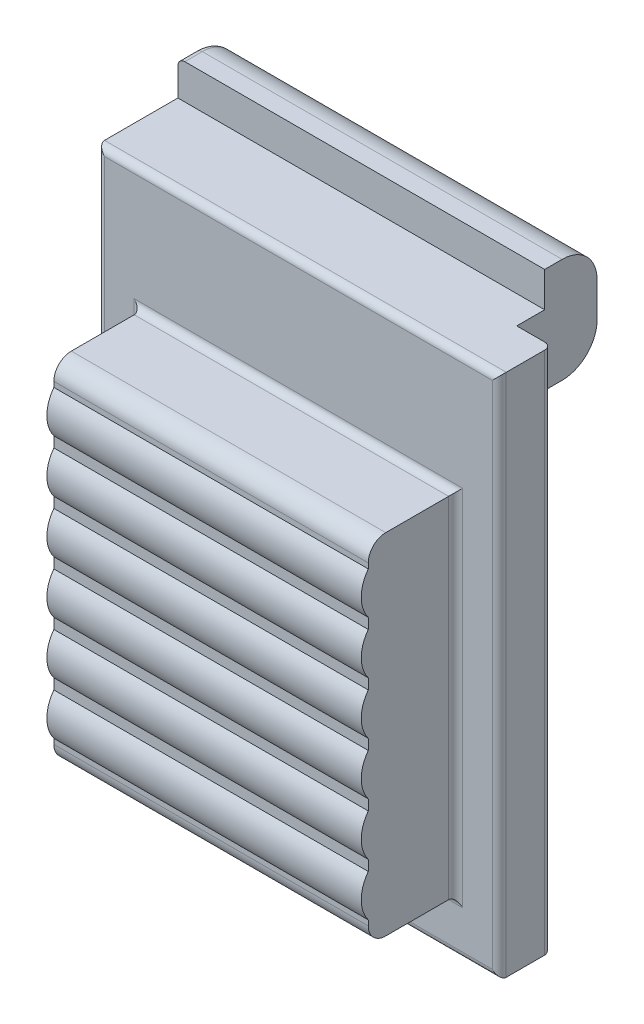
ISO-10303-21;
HEADER;
FILE_DESCRIPTION(('STEP AP214'),'2;1');
FILE_NAME('part.step','',(''),(''),'','','');
FILE_SCHEMA(('AUTOMOTIVE_DESIGN { 1 0 10303 214 1 1 1 1 }'));
ENDSEC;
DATA;
#1=APPLICATION_CONTEXT('core data for automotive mechanical design processes');
#2=APPLICATION_PROTOCOL_DEFINITION('international standard','automotive_design',2000,#1);
#3=PRODUCT_CONTEXT('',#1,'mechanical');
#4=PRODUCT('Part','Part','',(#3));
#5=PRODUCT_RELATED_PRODUCT_CATEGORY('part','',(#4));
#6=PRODUCT_DEFINITION_FORMATION('','',#4);
#7=PRODUCT_DEFINITION_CONTEXT('part definition',#1,'design');
#8=PRODUCT_DEFINITION('design','',#6,#7);
#9=PRODUCT_DEFINITION_SHAPE('','',#8);
#10=(LENGTH_UNIT() NAMED_UNIT(*) SI_UNIT(.MILLI.,.METRE.));
#11=(NAMED_UNIT(*) PLANE_ANGLE_UNIT() SI_UNIT($,.RADIAN.));
#12=(NAMED_UNIT(*) SI_UNIT($,.STERADIAN.) SOLID_ANGLE_UNIT());
#13=UNCERTAINTY_MEASURE_WITH_UNIT(LENGTH_MEASURE(1.E-05),#10,'distance_accuracy_value','');
#14=(GEOMETRIC_REPRESENTATION_CONTEXT(3) GLOBAL_UNCERTAINTY_ASSIGNED_CONTEXT((#13)) GLOBAL_UNIT_ASSIGNED_CONTEXT((#10,
#11,#12)) REPRESENTATION_CONTEXT('',''));
#15=CARTESIAN_POINT('',(0.,0.,0.));
#16=DIRECTION('',(0.,0.,1.));
#17=DIRECTION('',(1.,0.,0.));
#18=AXIS2_PLACEMENT_3D('',#15,#16,#17);
#19=CARTESIAN_POINT('',(1.25,1.5,4.));
#20=DIRECTION('',(0.,0.,1.));
#21=DIRECTION('',(1.,0.,0.));
#22=AXIS2_PLACEMENT_3D('',#19,#20,#21);
#23=PLANE('',#22);
#24=DIRECTION('',(-1.,0.,0.));
#25=VECTOR('',#24,1.);
#26=CARTESIAN_POINT('',(10.25,9.35,4.));
#27=LINE('',#26,#25);
#28=CARTESIAN_POINT('',(10.25,9.35,4.));
#29=VERTEX_POINT('',#28);
#30=CARTESIAN_POINT('',(1.25,9.35,4.));
#31=VERTEX_POINT('',#30);
#32=EDGE_CURVE('E795',#29,#31,#27,.T.);
#33=ORIENTED_EDGE('',*,*,#32,.F.);
#34=DIRECTION('',(0.,1.,0.));
#35=VECTOR('',#34,1.);
#36=CARTESIAN_POINT('',(10.25,11.5,4.));
#37=LINE('',#36,#35);
#38=CARTESIAN_POINT('',(10.25,9.65000000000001,4.));
#39=VERTEX_POINT('',#38);
#40=EDGE_CURVE('E562',#29,#39,#37,.T.);
#41=ORIENTED_EDGE('',*,*,#40,.T.);
#42=DIRECTION('',(-1.,0.,0.));
#43=VECTOR('',#42,1.);
#44=CARTESIAN_POINT('',(10.25,9.65000000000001,4.));
#45=LINE('',#44,#43);
#46=CARTESIAN_POINT('',(1.25,9.65,4.));
#47=VERTEX_POINT('',#46);
#48=EDGE_CURVE('E762',#47,#39,#45,.F.);
#49=ORIENTED_EDGE('',*,*,#48,.F.);
#50=DIRECTION('',(0.,-1.,0.));
#51=VECTOR('',#50,1.);
#52=CARTESIAN_POINT('',(1.25,11.5,4.));
#53=LINE('',#52,#51);
#54=EDGE_CURVE('E557',#47,#31,#53,.T.);
#55=ORIENTED_EDGE('',*,*,#54,.T.);
#56=EDGE_LOOP('',(#33,#41,#49,#55));
#57=FACE_BOUND('',#56,.T.);
#58=ADVANCED_FACE('F29',(#57),#23,.T.);
#59=DIRECTION('',(-1.,0.,0.));
#60=VECTOR('',#59,1.);
#61=CARTESIAN_POINT('',(10.25,8.15000000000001,4.));
#62=LINE('',#61,#60);
#63=CARTESIAN_POINT('',(1.25,8.15,4.));
#64=VERTEX_POINT('',#63);
#65=CARTESIAN_POINT('',(10.25,8.15000000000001,4.));
#66=VERTEX_POINT('',#65);
#67=EDGE_CURVE('E792',#64,#66,#62,.F.);
#68=ORIENTED_EDGE('',*,*,#67,.F.);
#69=CARTESIAN_POINT('',(1.25,7.85,4.));
#70=VERTEX_POINT('',#69);
#71=EDGE_CURVE('E988',#64,#70,#53,.T.);
#72=ORIENTED_EDGE('',*,*,#71,.T.);
#73=DIRECTION('',(-1.,0.,0.));
#74=VECTOR('',#73,1.);
#75=CARTESIAN_POINT('',(10.25,7.85,4.));
#76=LINE('',#75,#74);
#77=CARTESIAN_POINT('',(10.25,7.85,4.));
#78=VERTEX_POINT('',#77);
#79=EDGE_CURVE('E789',#78,#70,#76,.T.);
#80=ORIENTED_EDGE('',*,*,#79,.F.);
#81=EDGE_CURVE('E983',#78,#66,#37,.T.);
#82=ORIENTED_EDGE('',*,*,#81,.T.);
#83=EDGE_LOOP('',(#68,#72,#80,#82));
#84=FACE_BOUND('',#83,.T.);
#85=ADVANCED_FACE('F937',(#84),#23,.T.);
#86=DIRECTION('',(-1.,0.,0.));
#87=VECTOR('',#86,1.);
#88=CARTESIAN_POINT('',(10.25,6.65,4.));
#89=LINE('',#88,#87);
#90=CARTESIAN_POINT('',(1.25,6.65,4.));
#91=VERTEX_POINT('',#90);
#92=CARTESIAN_POINT('',(10.25,6.65,4.));
#93=VERTEX_POINT('',#92);
#94=EDGE_CURVE('E786',#91,#93,#89,.F.);
#95=ORIENTED_EDGE('',*,*,#94,.F.);
#96=CARTESIAN_POINT('',(1.25,6.35,4.));
#97=VERTEX_POINT('',#96);
#98=EDGE_CURVE('E1010',#91,#97,#53,.T.);
#99=ORIENTED_EDGE('',*,*,#98,.T.);
#100=DIRECTION('',(-1.,0.,0.));
#101=VECTOR('',#100,1.);
#102=CARTESIAN_POINT('',(10.25,6.35,4.));
#103=LINE('',#102,#101);
#104=CARTESIAN_POINT('',(10.25,6.35,4.));
#105=VERTEX_POINT('',#104);
#106=EDGE_CURVE('E783',#105,#97,#103,.T.);
#107=ORIENTED_EDGE('',*,*,#106,.F.);
#108=EDGE_CURVE('E990',#105,#93,#37,.T.);
#109=ORIENTED_EDGE('',*,*,#108,.T.);
#110=EDGE_LOOP('',(#95,#99,#107,#109));
#111=FACE_BOUND('',#110,.T.);
#112=ADVANCED_FACE('F944',(#111),#23,.T.);
#113=DIRECTION('',(-1.,0.,0.));
#114=VECTOR('',#113,1.);
#115=CARTESIAN_POINT('',(10.25,5.15,4.));
#116=LINE('',#115,#114);
#117=CARTESIAN_POINT('',(1.25,5.15,4.));
#118=VERTEX_POINT('',#117);
#119=CARTESIAN_POINT('',(10.25,5.15,4.));
#120=VERTEX_POINT('',#119);
#121=EDGE_CURVE('E780',#118,#120,#116,.F.);
#122=ORIENTED_EDGE('',*,*,#121,.F.);
#123=CARTESIAN_POINT('',(1.25,4.85,4.));
#124=VERTEX_POINT('',#123);
#125=EDGE_CURVE('E1008',#118,#124,#53,.T.);
#126=ORIENTED_EDGE('',*,*,#125,.T.);
#127=DIRECTION('',(-1.,0.,0.));
#128=VECTOR('',#127,1.);
#129=CARTESIAN_POINT('',(10.25,4.85,4.));
#130=LINE('',#129,#128);
#131=CARTESIAN_POINT('',(10.25,4.85,4.));
#132=VERTEX_POINT('',#131);
#133=EDGE_CURVE('E777',#132,#124,#130,.T.);
#134=ORIENTED_EDGE('',*,*,#133,.F.);
#135=EDGE_CURVE('E991',#132,#120,#37,.T.);
#136=ORIENTED_EDGE('',*,*,#135,.T.);
#137=EDGE_LOOP('',(#122,#126,#134,#136));
#138=FACE_BOUND('',#137,.T.);
#139=ADVANCED_FACE('F967',(#138),#23,.T.);
#140=DIRECTION('',(-1.,0.,0.));
#141=VECTOR('',#140,1.);
#142=CARTESIAN_POINT('',(10.25,3.65,4.));
#143=LINE('',#142,#141);
#144=CARTESIAN_POINT('',(1.25,3.65,4.));
#145=VERTEX_POINT('',#144);
#146=CARTESIAN_POINT('',(10.25,3.65,4.));
#147=VERTEX_POINT('',#146);
#148=EDGE_CURVE('E774',#145,#147,#143,.F.);
#149=ORIENTED_EDGE('',*,*,#148,.F.);
#150=CARTESIAN_POINT('',(1.25,3.35,4.));
#151=VERTEX_POINT('',#150);
#152=EDGE_CURVE('E1011',#145,#151,#53,.T.);
#153=ORIENTED_EDGE('',*,*,#152,.T.);
#154=DIRECTION('',(-1.,0.,0.));
#155=VECTOR('',#154,1.);
#156=CARTESIAN_POINT('',(10.25,3.35,4.));
#157=LINE('',#156,#155);
#158=CARTESIAN_POINT('',(10.25,3.35,4.));
#159=VERTEX_POINT('',#158);
#160=EDGE_CURVE('E771',#159,#151,#157,.T.);
#161=ORIENTED_EDGE('',*,*,#160,.F.);
#162=EDGE_CURVE('E561',#159,#147,#37,.T.);
#163=ORIENTED_EDGE('',*,*,#162,.T.);
#164=EDGE_LOOP('',(#149,#153,#161,#163));
#165=FACE_BOUND('',#164,.T.);
#166=ADVANCED_FACE('F960',(#165),#23,.T.);
#167=CARTESIAN_POINT('',(10.25,10.85,4.));
#168=VERTEX_POINT('',#167);
#169=CARTESIAN_POINT('',(10.25,11.,4.));
#170=VERTEX_POINT('',#169);
#171=EDGE_CURVE('E556',#168,#170,#37,.T.);
#172=ORIENTED_EDGE('',*,*,#171,.T.);
#173=DIRECTION('',(-1.,0.,0.));
#174=VECTOR('',#173,1.);
#175=CARTESIAN_POINT('',(1.25,11.,4.));
#176=LINE('',#175,#174);
#177=CARTESIAN_POINT('',(1.25,11.,4.));
#178=VERTEX_POINT('',#177);
#179=EDGE_CURVE('E798',#170,#178,#176,.T.);
#180=ORIENTED_EDGE('',*,*,#179,.T.);
#181=CARTESIAN_POINT('',(1.25,10.85,4.));
#182=VERTEX_POINT('',#181);
#183=EDGE_CURVE('E554',#178,#182,#53,.T.);
#184=ORIENTED_EDGE('',*,*,#183,.T.);
#185=DIRECTION('',(-1.,0.,0.));
#186=VECTOR('',#185,1.);
#187=CARTESIAN_POINT('',(10.25,10.85,4.));
#188=LINE('',#187,#186);
#189=EDGE_CURVE('E765',#168,#182,#188,.T.);
#190=ORIENTED_EDGE('',*,*,#189,.F.);
#191=EDGE_LOOP('',(#172,#180,#184,#190));
#192=FACE_BOUND('',#191,.T.);
#193=ADVANCED_FACE('F951',(#192),#23,.T.);
#194=CARTESIAN_POINT('',(0.,15.,0.));
#195=DIRECTION('',(0.,0.,-1.));
#196=DIRECTION('',(-1.,0.,0.));
#197=AXIS2_PLACEMENT_3D('',#194,#195,#196);
#198=PLANE('',#197);
#199=DIRECTION('',(-1.,0.,0.));
#200=VECTOR('',#199,1.);
#201=CARTESIAN_POINT('',(0.,15.,0.));
#202=LINE('',#201,#200);
#203=CARTESIAN_POINT('',(11.3,15.,0.));
#204=VERTEX_POINT('',#203);
#205=CARTESIAN_POINT('',(10.5,15.,0.));
#206=VERTEX_POINT('',#205);
#207=EDGE_CURVE('E376',#204,#206,#202,.T.);
#208=ORIENTED_EDGE('',*,*,#207,.F.);
#209=DIRECTION('',(0.,1.,0.));
#210=VECTOR('',#209,1.);
#211=CARTESIAN_POINT('',(11.3,0.,0.));
#212=LINE('',#211,#210);
#213=CARTESIAN_POINT('',(11.3,0.2,0.));
#214=VERTEX_POINT('',#213);
#215=EDGE_CURVE('E51',#204,#214,#212,.F.);
#216=ORIENTED_EDGE('',*,*,#215,.T.);
#217=DIRECTION('',(1.,0.,0.));
#218=VECTOR('',#217,1.);
#219=CARTESIAN_POINT('',(0.,0.2,0.));
#220=LINE('',#219,#218);
#221=CARTESIAN_POINT('',(0.2,0.2,0.));
#222=VERTEX_POINT('',#221);
#223=EDGE_CURVE('E628',#214,#222,#220,.F.);
#224=ORIENTED_EDGE('',*,*,#223,.T.);
#225=DIRECTION('',(0.,-1.,0.));
#226=VECTOR('',#225,1.);
#227=CARTESIAN_POINT('',(0.2,12.8,0.));
#228=LINE('',#227,#226);
#229=CARTESIAN_POINT('',(0.2,12.8,0.));
#230=VERTEX_POINT('',#229);
#231=EDGE_CURVE('E626',#222,#230,#228,.F.);
#232=ORIENTED_EDGE('',*,*,#231,.T.);
#233=DIRECTION('',(-1.,0.,0.));
#234=VECTOR('',#233,1.);
#235=CARTESIAN_POINT('',(0.,12.8,0.));
#236=LINE('',#235,#234);
#237=CARTESIAN_POINT('',(10.5,12.8,0.));
#238=VERTEX_POINT('',#237);
#239=EDGE_CURVE('E652',#230,#238,#236,.F.);
#240=ORIENTED_EDGE('',*,*,#239,.T.);
#241=DIRECTION('',(0.,-1.,0.));
#242=VECTOR('',#241,1.);
#243=CARTESIAN_POINT('',(10.5,16.,0.));
#244=LINE('',#243,#242);
#245=EDGE_CURVE('E540',#206,#238,#244,.T.);
#246=ORIENTED_EDGE('',*,*,#245,.F.);
#247=EDGE_LOOP('',(#208,#216,#224,#232,#240,#246));
#248=FACE_BOUND('',#247,.T.);
#249=CARTESIAN_POINT('',(2.95,3.2,0.));
#250=DIRECTION('',(0.,0.,-1.));
#251=DIRECTION('',(-1.,0.,0.));
#252=AXIS2_PLACEMENT_3D('',#249,#250,#251);
#253=CIRCLE('',#252,0.4);
#254=CARTESIAN_POINT('',(2.95,2.8,0.));
#255=VERTEX_POINT('',#254);
#256=CARTESIAN_POINT('',(2.55,3.2,0.));
#257=VERTEX_POINT('',#256);
#258=EDGE_CURVE('E723',#255,#257,#253,.T.);
#259=ORIENTED_EDGE('',*,*,#258,.F.);
#260=DIRECTION('',(-1.,0.,0.));
#261=VECTOR('',#260,1.);
#262=CARTESIAN_POINT('',(8.75,2.8,0.));
#263=LINE('',#262,#261);
#264=CARTESIAN_POINT('',(8.55,2.8,0.));
#265=VERTEX_POINT('',#264);
#266=EDGE_CURVE('E720',#255,#265,#263,.F.);
#267=ORIENTED_EDGE('',*,*,#266,.T.);
#268=CARTESIAN_POINT('',(8.55,3.2,0.));
#269=DIRECTION('',(0.,0.,-1.));
#270=DIRECTION('',(-1.,0.,0.));
#271=AXIS2_PLACEMENT_3D('',#268,#269,#270);
#272=CIRCLE('',#271,0.4);
#273=CARTESIAN_POINT('',(8.95,3.2,0.));
#274=VERTEX_POINT('',#273);
#275=EDGE_CURVE('E717',#274,#265,#272,.T.);
#276=ORIENTED_EDGE('',*,*,#275,.F.);
#277=DIRECTION('',(0.,-1.,0.));
#278=VECTOR('',#277,1.);
#279=CARTESIAN_POINT('',(8.95,10.,0.));
#280=LINE('',#279,#278);
#281=CARTESIAN_POINT('',(8.95,9.8,0.));
#282=VERTEX_POINT('',#281);
#283=EDGE_CURVE('E713',#274,#282,#280,.F.);
#284=ORIENTED_EDGE('',*,*,#283,.T.);
#285=CARTESIAN_POINT('',(8.55,9.8,0.));
#286=DIRECTION('',(0.,0.,-1.));
#287=DIRECTION('',(-1.,0.,0.));
#288=AXIS2_PLACEMENT_3D('',#285,#286,#287);
#289=CIRCLE('',#288,0.4);
#290=CARTESIAN_POINT('',(8.55,10.2,0.));
#291=VERTEX_POINT('',#290);
#292=EDGE_CURVE('E710',#291,#282,#289,.T.);
#293=ORIENTED_EDGE('',*,*,#292,.F.);
#294=DIRECTION('',(1.,0.,0.));
#295=VECTOR('',#294,1.);
#296=CARTESIAN_POINT('',(2.75,10.2,0.));
#297=LINE('',#296,#295);
#298=CARTESIAN_POINT('',(2.95,10.2,0.));
#299=VERTEX_POINT('',#298);
#300=EDGE_CURVE('E708',#291,#299,#297,.F.);
#301=ORIENTED_EDGE('',*,*,#300,.T.);
#302=CARTESIAN_POINT('',(2.95,9.8,0.));
#303=DIRECTION('',(0.,0.,-1.));
#304=DIRECTION('',(-1.,0.,0.));
#305=AXIS2_PLACEMENT_3D('',#302,#303,#304);
#306=CIRCLE('',#305,0.4);
#307=CARTESIAN_POINT('',(2.55,9.8,0.));
#308=VERTEX_POINT('',#307);
#309=EDGE_CURVE('E705',#308,#299,#306,.T.);
#310=ORIENTED_EDGE('',*,*,#309,.F.);
#311=DIRECTION('',(0.,1.,0.));
#312=VECTOR('',#311,1.);
#313=CARTESIAN_POINT('',(2.55,3.,0.));
#314=LINE('',#313,#312);
#315=EDGE_CURVE('E715',#308,#257,#314,.F.);
#316=ORIENTED_EDGE('',*,*,#315,.T.);
#317=EDGE_LOOP('',(#259,#267,#276,#284,#293,#301,#310,#316));
#318=FACE_BOUND('',#317,.T.);
#319=ADVANCED_FACE('F648',(#248,#318),#198,.T.);
#320=CARTESIAN_POINT('',(0.,15.,1.5));
#321=DIRECTION('',(0.,0.,-1.));
#322=DIRECTION('',(-1.,0.,0.));
#323=AXIS2_PLACEMENT_3D('',#320,#321,#322);
#324=PLANE('',#323);
#325=DIRECTION('',(0.,1.,0.));
#326=VECTOR('',#325,1.);
#327=CARTESIAN_POINT('',(10.45,1.5,1.5));
#328=LINE('',#327,#326);
#329=CARTESIAN_POINT('',(10.45,11.7,1.5));
#330=VERTEX_POINT('',#329);
#331=CARTESIAN_POINT('',(10.45,1.3,1.5));
#332=VERTEX_POINT('',#331);
#333=EDGE_CURVE('E832',#330,#332,#328,.F.);
#334=ORIENTED_EDGE('',*,*,#333,.T.);
#335=DIRECTION('',(1.,0.,0.));
#336=VECTOR('',#335,1.);
#337=CARTESIAN_POINT('',(1.25,1.3,1.5));
#338=LINE('',#337,#336);
#339=CARTESIAN_POINT('',(1.05,1.3,1.5));
#340=VERTEX_POINT('',#339);
#341=EDGE_CURVE('E834',#332,#340,#338,.F.);
#342=ORIENTED_EDGE('',*,*,#341,.T.);
#343=DIRECTION('',(0.,-1.,0.));
#344=VECTOR('',#343,1.);
#345=CARTESIAN_POINT('',(1.05,11.5,1.5));
#346=LINE('',#345,#344);
#347=CARTESIAN_POINT('',(1.05,11.7,1.5));
#348=VERTEX_POINT('',#347);
#349=EDGE_CURVE('E828',#340,#348,#346,.F.);
#350=ORIENTED_EDGE('',*,*,#349,.T.);
#351=DIRECTION('',(-1.,0.,0.));
#352=VECTOR('',#351,1.);
#353=CARTESIAN_POINT('',(10.25,11.7,1.5));
#354=LINE('',#353,#352);
#355=EDGE_CURVE('E830',#348,#330,#354,.F.);
#356=ORIENTED_EDGE('',*,*,#355,.T.);
#357=EDGE_LOOP('',(#334,#342,#350,#356));
#358=FACE_BOUND('',#357,.T.);
#359=DIRECTION('',(0.,1.,0.));
#360=VECTOR('',#359,1.);
#361=CARTESIAN_POINT('',(11.3,15.,1.5));
#362=LINE('',#361,#360);
#363=CARTESIAN_POINT('',(11.3,0.200000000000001,1.5));
#364=VERTEX_POINT('',#363);
#365=CARTESIAN_POINT('',(11.3,14.8,1.5));
#366=VERTEX_POINT('',#365);
#367=EDGE_CURVE('E823',#364,#366,#362,.T.);
#368=ORIENTED_EDGE('',*,*,#367,.T.);
#369=DIRECTION('',(-1.,0.,0.));
#370=VECTOR('',#369,1.);
#371=CARTESIAN_POINT('',(0.,14.8,1.5));
#372=LINE('',#371,#370);
#373=CARTESIAN_POINT('',(0.2,14.8,1.5));
#374=VERTEX_POINT('',#373);
#375=EDGE_CURVE('E825',#366,#374,#372,.T.);
#376=ORIENTED_EDGE('',*,*,#375,.T.);
#377=DIRECTION('',(0.,-1.,0.));
#378=VECTOR('',#377,1.);
#379=CARTESIAN_POINT('',(0.2,15.,1.5));
#380=LINE('',#379,#378);
#381=CARTESIAN_POINT('',(0.2,0.200000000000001,1.5));
#382=VERTEX_POINT('',#381);
#383=EDGE_CURVE('E819',#374,#382,#380,.T.);
#384=ORIENTED_EDGE('',*,*,#383,.T.);
#385=DIRECTION('',(1.,0.,0.));
#386=VECTOR('',#385,1.);
#387=CARTESIAN_POINT('',(0.,0.200000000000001,1.5));
#388=LINE('',#387,#386);
#389=EDGE_CURVE('E821',#382,#364,#388,.T.);
#390=ORIENTED_EDGE('',*,*,#389,.T.);
#391=EDGE_LOOP('',(#368,#376,#384,#390));
#392=FACE_BOUND('',#391,.T.);
#393=ADVANCED_FACE('F876',(#358,#392),#324,.F.);
#394=CARTESIAN_POINT('',(0.,0.,1.5));
#395=DIRECTION('',(1.,0.,0.));
#396=DIRECTION('',(0.,0.,-1.));
#397=AXIS2_PLACEMENT_3D('',#394,#395,#396);
#398=PLANE('',#397);
#399=DIRECTION('',(0.,0.,-1.));
#400=VECTOR('',#399,1.);
#401=CARTESIAN_POINT('',(0.,15.,1.5));
#402=LINE('',#401,#400);
#403=CARTESIAN_POINT('',(0.,15.,1.3));
#404=VERTEX_POINT('',#403);
#405=CARTESIAN_POINT('',(0.,15.,-0.8));
#406=VERTEX_POINT('',#405);
#407=EDGE_CURVE('E364',#404,#406,#402,.T.);
#408=ORIENTED_EDGE('',*,*,#407,.T.);
#409=DIRECTION('',(0.,-1.,0.));
#410=VECTOR('',#409,1.);
#411=CARTESIAN_POINT('',(0.,15.,-0.8));
#412=LINE('',#411,#410);
#413=CARTESIAN_POINT('',(0.,15.8,-0.8));
#414=VERTEX_POINT('',#413);
#415=EDGE_CURVE('E366',#414,#406,#412,.T.);
#416=ORIENTED_EDGE('',*,*,#415,.F.);
#417=DIRECTION('',(0.,0.,1.));
#418=VECTOR('',#417,1.);
#419=CARTESIAN_POINT('',(0.,15.8,1.5));
#420=LINE('',#419,#418);
#421=CARTESIAN_POINT('',(0.,15.8,-1.3));
#422=VERTEX_POINT('',#421);
#423=EDGE_CURVE('E610',#414,#422,#420,.F.);
#424=ORIENTED_EDGE('',*,*,#423,.T.);
#425=CARTESIAN_POINT('',(0.,15.,-1.3));
#426=DIRECTION('',(1.,0.,0.));
#427=DIRECTION('',(0.,0.,-1.));
#428=AXIS2_PLACEMENT_3D('',#425,#426,#427);
#429=CIRCLE('',#428,0.8);
#430=CARTESIAN_POINT('',(0.,15.,-2.1));
#431=VERTEX_POINT('',#430);
#432=EDGE_CURVE('E608',#422,#431,#429,.F.);
#433=ORIENTED_EDGE('',*,*,#432,.T.);
#434=DIRECTION('',(0.,1.,0.));
#435=VECTOR('',#434,1.);
#436=CARTESIAN_POINT('',(0.,14.,-2.1));
#437=LINE('',#436,#435);
#438=CARTESIAN_POINT('',(0.,14.,-2.1));
#439=VERTEX_POINT('',#438);
#440=EDGE_CURVE('E606',#431,#439,#437,.F.);
#441=ORIENTED_EDGE('',*,*,#440,.T.);
#442=CARTESIAN_POINT('',(0.,14.,-1.3));
#443=DIRECTION('',(1.,0.,0.));
#444=DIRECTION('',(0.,0.,-1.));
#445=AXIS2_PLACEMENT_3D('',#442,#443,#444);
#446=CIRCLE('',#445,0.8);
#447=CARTESIAN_POINT('',(0.,13.2,-1.3));
#448=VERTEX_POINT('',#447);
#449=EDGE_CURVE('E604',#439,#448,#446,.F.);
#450=ORIENTED_EDGE('',*,*,#449,.T.);
#451=DIRECTION('',(0.,0.,1.));
#452=VECTOR('',#451,1.);
#453=CARTESIAN_POINT('',(0.,13.2,1.5));
#454=LINE('',#453,#452);
#455=CARTESIAN_POINT('',(0.,13.2,-0.2));
#456=VERTEX_POINT('',#455);
#457=EDGE_CURVE('E602',#448,#456,#454,.T.);
#458=ORIENTED_EDGE('',*,*,#457,.T.);
#459=CARTESIAN_POINT('',(0.,12.8,-0.2));
#460=DIRECTION('',(1.,0.,0.));
#461=DIRECTION('',(0.,0.,-1.));
#462=AXIS2_PLACEMENT_3D('',#459,#460,#461);
#463=CIRCLE('',#462,0.4);
#464=CARTESIAN_POINT('',(0.,12.8,0.2));
#465=VERTEX_POINT('',#464);
#466=EDGE_CURVE('E600',#456,#465,#463,.T.);
#467=ORIENTED_EDGE('',*,*,#466,.T.);
#468=DIRECTION('',(0.,-1.,0.));
#469=VECTOR('',#468,1.);
#470=CARTESIAN_POINT('',(0.,0.,0.2));
#471=LINE('',#470,#469);
#472=CARTESIAN_POINT('',(0.,0.,0.2));
#473=VERTEX_POINT('',#472);
#474=EDGE_CURVE('E598',#465,#473,#471,.T.);
#475=ORIENTED_EDGE('',*,*,#474,.T.);
#476=DIRECTION('',(0.,0.,-1.));
#477=VECTOR('',#476,1.);
#478=CARTESIAN_POINT('',(0.,0.,1.5));
#479=LINE('',#478,#477);
#480=CARTESIAN_POINT('',(0.,0.,1.3));
#481=VERTEX_POINT('',#480);
#482=EDGE_CURVE('E544',#481,#473,#479,.T.);
#483=ORIENTED_EDGE('',*,*,#482,.F.);
#484=DIRECTION('',(0.,-1.,0.));
#485=VECTOR('',#484,1.);
#486=CARTESIAN_POINT('',(0.,0.,1.3));
#487=LINE('',#486,#485);
#488=EDGE_CURVE('E370',#481,#404,#487,.F.);
#489=ORIENTED_EDGE('',*,*,#488,.T.);
#490=EDGE_LOOP('',(#408,#416,#424,#433,#441,#450,#458,#467,#475,#483,#489));
#491=FACE_BOUND('',#490,.T.);
#492=ADVANCED_FACE('F31',(#491),#398,.F.);
#493=CARTESIAN_POINT('',(0.,0.,1.5));
#494=DIRECTION('',(0.,1.,0.));
#495=DIRECTION('',(0.,0.,1.));
#496=AXIS2_PLACEMENT_3D('',#493,#494,#495);
#497=PLANE('',#496);
#498=ORIENTED_EDGE('',*,*,#482,.T.);
#499=DIRECTION('',(1.,0.,0.));
#500=VECTOR('',#499,1.);
#501=CARTESIAN_POINT('',(11.5,0.,0.2));
#502=LINE('',#501,#500);
#503=CARTESIAN_POINT('',(11.5,0.,0.2));
#504=VERTEX_POINT('',#503);
#505=EDGE_CURVE('E37',#473,#504,#502,.T.);
#506=ORIENTED_EDGE('',*,*,#505,.T.);
#507=DIRECTION('',(0.,0.,-1.));
#508=VECTOR('',#507,1.);
#509=CARTESIAN_POINT('',(11.5,0.,1.5));
#510=LINE('',#509,#508);
#511=CARTESIAN_POINT('',(11.5,0.,1.3));
#512=VERTEX_POINT('',#511);
#513=EDGE_CURVE('E576',#512,#504,#510,.T.);
#514=ORIENTED_EDGE('',*,*,#513,.F.);
#515=DIRECTION('',(1.,0.,0.));
#516=VECTOR('',#515,1.);
#517=CARTESIAN_POINT('',(0.,0.,1.3));
#518=LINE('',#517,#516);
#519=EDGE_CURVE('E592',#512,#481,#518,.F.);
#520=ORIENTED_EDGE('',*,*,#519,.T.);
#521=EDGE_LOOP('',(#498,#506,#514,#520));
#522=FACE_BOUND('',#521,.T.);
#523=ADVANCED_FACE('F633',(#522),#497,.F.);
#524=CARTESIAN_POINT('',(11.5,0.,1.5));
#525=DIRECTION('',(-1.,0.,0.));
#526=DIRECTION('',(0.,0.,1.));
#527=AXIS2_PLACEMENT_3D('',#524,#525,#526);
#528=PLANE('',#527);
#529=ORIENTED_EDGE('',*,*,#513,.T.);
#530=DIRECTION('',(0.,1.,0.));
#531=VECTOR('',#530,1.);
#532=CARTESIAN_POINT('',(11.5,15.,0.2));
#533=LINE('',#532,#531);
#534=CARTESIAN_POINT('',(11.5,15.,0.2));
#535=VERTEX_POINT('',#534);
#536=EDGE_CURVE('E622',#504,#535,#533,.T.);
#537=ORIENTED_EDGE('',*,*,#536,.T.);
#538=DIRECTION('',(0.,0.,-1.));
#539=VECTOR('',#538,1.);
#540=CARTESIAN_POINT('',(11.5,15.,1.5));
#541=LINE('',#540,#539);
#542=CARTESIAN_POINT('',(11.5,15.,1.3));
#543=VERTEX_POINT('',#542);
#544=EDGE_CURVE('E375',#543,#535,#541,.T.);
#545=ORIENTED_EDGE('',*,*,#544,.F.);
#546=DIRECTION('',(0.,1.,0.));
#547=VECTOR('',#546,1.);
#548=CARTESIAN_POINT('',(11.5,0.,1.3));
#549=LINE('',#548,#547);
#550=EDGE_CURVE('E590',#543,#512,#549,.F.);
#551=ORIENTED_EDGE('',*,*,#550,.T.);
#552=EDGE_LOOP('',(#529,#537,#545,#551));
#553=FACE_BOUND('',#552,.T.);
#554=ADVANCED_FACE('F639',(#553),#528,.F.);
#555=CARTESIAN_POINT('',(0.,15.,1.5));
#556=DIRECTION('',(0.,-1.,0.));
#557=DIRECTION('',(0.,0.,-1.));
#558=AXIS2_PLACEMENT_3D('',#555,#556,#557);
#559=PLANE('',#558);
#560=ORIENTED_EDGE('',*,*,#544,.T.);
#561=CARTESIAN_POINT('',(11.3,15.,0.2));
#562=DIRECTION('',(0.,-1.,0.));
#563=DIRECTION('',(0.,0.,-1.));
#564=AXIS2_PLACEMENT_3D('',#561,#562,#563);
#565=CIRCLE('',#564,0.2);
#566=EDGE_CURVE('E624',#535,#204,#565,.F.);
#567=ORIENTED_EDGE('',*,*,#566,.T.);
#568=ORIENTED_EDGE('',*,*,#207,.T.);
#569=DIRECTION('',(0.,0.,1.));
#570=VECTOR('',#569,1.);
#571=CARTESIAN_POINT('',(10.5,15.,-2.3));
#572=LINE('',#571,#570);
#573=CARTESIAN_POINT('',(10.5,15.,-0.8));
#574=VERTEX_POINT('',#573);
#575=EDGE_CURVE('E386',#574,#206,#572,.T.);
#576=ORIENTED_EDGE('',*,*,#575,.F.);
#577=DIRECTION('',(1.,0.,0.));
#578=VECTOR('',#577,1.);
#579=CARTESIAN_POINT('',(0.,15.,-0.8));
#580=LINE('',#579,#578);
#581=EDGE_CURVE('E380',#406,#574,#580,.T.);
#582=ORIENTED_EDGE('',*,*,#581,.F.);
#583=ORIENTED_EDGE('',*,*,#407,.F.);
#584=DIRECTION('',(-1.,0.,0.));
#585=VECTOR('',#584,1.);
#586=CARTESIAN_POINT('',(0.,15.,1.3));
#587=LINE('',#586,#585);
#588=EDGE_CURVE('E588',#404,#543,#587,.F.);
#589=ORIENTED_EDGE('',*,*,#588,.T.);
#590=EDGE_LOOP('',(#560,#567,#568,#576,#582,#583,#589));
#591=FACE_BOUND('',#590,.T.);
#592=ADVANCED_FACE('F384',(#591),#559,.F.);
#593=CARTESIAN_POINT('',(1.25,11.5,4.));
#594=DIRECTION('',(1.,0.,0.));
#595=DIRECTION('',(0.,1.,0.));
#596=AXIS2_PLACEMENT_3D('',#593,#594,#595);
#597=PLANE('',#596);
#598=DIRECTION('',(0.,0.,-1.));
#599=VECTOR('',#598,1.);
#600=CARTESIAN_POINT('',(1.25,11.5,4.));
#601=LINE('',#600,#599);
#602=CARTESIAN_POINT('',(1.25,11.5,3.5));
#603=VERTEX_POINT('',#602);
#604=CARTESIAN_POINT('',(1.25,11.5,1.7));
#605=VERTEX_POINT('',#604);
#606=EDGE_CURVE('E560',#603,#605,#601,.T.);
#607=ORIENTED_EDGE('',*,*,#606,.T.);
#608=DIRECTION('',(0.,-1.,0.));
#609=VECTOR('',#608,1.);
#610=CARTESIAN_POINT('',(1.25,1.5,1.7));
#611=LINE('',#610,#609);
#612=CARTESIAN_POINT('',(1.25,1.5,1.7));
#613=VERTEX_POINT('',#612);
#614=EDGE_CURVE('E586',#605,#613,#611,.T.);
#615=ORIENTED_EDGE('',*,*,#614,.T.);
#616=DIRECTION('',(0.,0.,-1.));
#617=VECTOR('',#616,1.);
#618=CARTESIAN_POINT('',(1.25,1.5,4.));
#619=LINE('',#618,#617);
#620=CARTESIAN_POINT('',(1.25,1.5,3.5));
#621=VERTEX_POINT('',#620);
#622=EDGE_CURVE('E571',#621,#613,#619,.T.);
#623=ORIENTED_EDGE('',*,*,#622,.F.);
#624=CARTESIAN_POINT('',(1.25,2.,3.5));
#625=DIRECTION('',(1.,0.,0.));
#626=DIRECTION('',(0.,1.,0.));
#627=AXIS2_PLACEMENT_3D('',#624,#625,#626);
#628=CIRCLE('',#627,0.5);
#629=CARTESIAN_POINT('',(1.25,2.,4.));
#630=VERTEX_POINT('',#629);
#631=EDGE_CURVE('E801',#621,#630,#628,.F.);
#632=ORIENTED_EDGE('',*,*,#631,.T.);
#633=CARTESIAN_POINT('',(1.25,2.15,4.));
#634=VERTEX_POINT('',#633);
#635=EDGE_CURVE('E553',#634,#630,#53,.T.);
#636=ORIENTED_EDGE('',*,*,#635,.F.);
#637=CARTESIAN_POINT('',(1.25,2.75,3.2));
#638=DIRECTION('',(-1.,0.,0.));
#639=DIRECTION('',(0.,-1.,0.));
#640=AXIS2_PLACEMENT_3D('',#637,#638,#639);
#641=CIRCLE('',#640,0.999999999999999);
#642=EDGE_CURVE('E437',#634,#151,#641,.T.);
#643=ORIENTED_EDGE('',*,*,#642,.T.);
#644=ORIENTED_EDGE('',*,*,#152,.F.);
#645=CARTESIAN_POINT('',(1.25,4.25,3.2));
#646=DIRECTION('',(-1.,0.,0.));
#647=DIRECTION('',(0.,-1.,0.));
#648=AXIS2_PLACEMENT_3D('',#645,#646,#647);
#649=CIRCLE('',#648,0.999999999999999);
#650=EDGE_CURVE('E443',#145,#124,#649,.T.);
#651=ORIENTED_EDGE('',*,*,#650,.T.);
#652=ORIENTED_EDGE('',*,*,#125,.F.);
#653=CARTESIAN_POINT('',(1.25,5.75,3.2));
#654=DIRECTION('',(-1.,0.,0.));
#655=DIRECTION('',(0.,-1.,0.));
#656=AXIS2_PLACEMENT_3D('',#653,#654,#655);
#657=CIRCLE('',#656,0.999999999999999);
#658=EDGE_CURVE('E449',#118,#97,#657,.T.);
#659=ORIENTED_EDGE('',*,*,#658,.T.);
#660=ORIENTED_EDGE('',*,*,#98,.F.);
#661=CARTESIAN_POINT('',(1.25,7.25,3.2));
#662=DIRECTION('',(-1.,0.,0.));
#663=DIRECTION('',(0.,-1.,0.));
#664=AXIS2_PLACEMENT_3D('',#661,#662,#663);
#665=CIRCLE('',#664,0.999999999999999);
#666=EDGE_CURVE('E455',#91,#70,#665,.T.);
#667=ORIENTED_EDGE('',*,*,#666,.T.);
#668=ORIENTED_EDGE('',*,*,#71,.F.);
#669=CARTESIAN_POINT('',(1.25,8.75,3.2));
#670=DIRECTION('',(-1.,0.,0.));
#671=DIRECTION('',(0.,-1.,0.));
#672=AXIS2_PLACEMENT_3D('',#669,#670,#671);
#673=CIRCLE('',#672,0.999999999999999);
#674=EDGE_CURVE('E461',#64,#31,#673,.T.);
#675=ORIENTED_EDGE('',*,*,#674,.T.);
#676=ORIENTED_EDGE('',*,*,#54,.F.);
#677=CARTESIAN_POINT('',(1.25,10.25,3.2));
#678=DIRECTION('',(-1.,0.,0.));
#679=DIRECTION('',(0.,-1.,0.));
#680=AXIS2_PLACEMENT_3D('',#677,#678,#679);
#681=CIRCLE('',#680,0.999999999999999);
#682=EDGE_CURVE('E467',#47,#182,#681,.T.);
#683=ORIENTED_EDGE('',*,*,#682,.T.);
#684=ORIENTED_EDGE('',*,*,#183,.F.);
#685=CARTESIAN_POINT('',(1.25,11.,3.5));
#686=DIRECTION('',(1.,0.,0.));
#687=DIRECTION('',(0.,1.,0.));
#688=AXIS2_PLACEMENT_3D('',#685,#686,#687);
#689=CIRCLE('',#688,0.5);
#690=EDGE_CURVE('E803',#178,#603,#689,.F.);
#691=ORIENTED_EDGE('',*,*,#690,.T.);
#692=EDGE_LOOP('',(#607,#615,#623,#632,#636,#643,#644,#651,#652,#659,#660,#667,#668,#675,#676,
#683,#684,#691));
#693=FACE_BOUND('',#692,.T.);
#694=ADVANCED_FACE('F845',(#693),#597,.F.);
#695=CARTESIAN_POINT('',(1.25,1.5,4.));
#696=DIRECTION('',(0.,1.,0.));
#697=DIRECTION('',(0.,0.,1.));
#698=AXIS2_PLACEMENT_3D('',#695,#696,#697);
#699=PLANE('',#698);
#700=ORIENTED_EDGE('',*,*,#622,.T.);
#701=DIRECTION('',(1.,0.,0.));
#702=VECTOR('',#701,1.);
#703=CARTESIAN_POINT('',(10.25,1.5,1.7));
#704=LINE('',#703,#702);
#705=CARTESIAN_POINT('',(10.25,1.5,1.7));
#706=VERTEX_POINT('',#705);
#707=EDGE_CURVE('E816',#613,#706,#704,.T.);
#708=ORIENTED_EDGE('',*,*,#707,.T.);
#709=DIRECTION('',(0.,0.,-1.));
#710=VECTOR('',#709,1.);
#711=CARTESIAN_POINT('',(10.25,1.5,4.));
#712=LINE('',#711,#710);
#713=CARTESIAN_POINT('',(10.25,1.5,3.5));
#714=VERTEX_POINT('',#713);
#715=EDGE_CURVE('E568',#714,#706,#712,.T.);
#716=ORIENTED_EDGE('',*,*,#715,.F.);
#717=DIRECTION('',(1.,0.,0.));
#718=VECTOR('',#717,1.);
#719=CARTESIAN_POINT('',(1.25,1.5,3.5));
#720=LINE('',#719,#718);
#721=EDGE_CURVE('E814',#714,#621,#720,.F.);
#722=ORIENTED_EDGE('',*,*,#721,.T.);
#723=EDGE_LOOP('',(#700,#708,#716,#722));
#724=FACE_BOUND('',#723,.T.);
#725=ADVANCED_FACE('F851',(#724),#699,.F.);
#726=CARTESIAN_POINT('',(10.25,11.5,4.));
#727=DIRECTION('',(-1.,0.,0.));
#728=DIRECTION('',(0.,-1.,0.));
#729=AXIS2_PLACEMENT_3D('',#726,#727,#728);
#730=PLANE('',#729);
#731=ORIENTED_EDGE('',*,*,#715,.T.);
#732=DIRECTION('',(0.,1.,0.));
#733=VECTOR('',#732,1.);
#734=CARTESIAN_POINT('',(10.25,11.5,1.7));
#735=LINE('',#734,#733);
#736=CARTESIAN_POINT('',(10.25,11.5,1.7));
#737=VERTEX_POINT('',#736);
#738=EDGE_CURVE('E837',#706,#737,#735,.T.);
#739=ORIENTED_EDGE('',*,*,#738,.T.);
#740=DIRECTION('',(0.,0.,-1.));
#741=VECTOR('',#740,1.);
#742=CARTESIAN_POINT('',(10.25,11.5,4.));
#743=LINE('',#742,#741);
#744=CARTESIAN_POINT('',(10.25,11.5,3.5));
#745=VERTEX_POINT('',#744);
#746=EDGE_CURVE('E565',#745,#737,#743,.T.);
#747=ORIENTED_EDGE('',*,*,#746,.F.);
#748=CARTESIAN_POINT('',(10.25,11.,3.5));
#749=DIRECTION('',(-1.,0.,0.));
#750=DIRECTION('',(0.,-1.,0.));
#751=AXIS2_PLACEMENT_3D('',#748,#749,#750);
#752=CIRCLE('',#751,0.5);
#753=EDGE_CURVE('E809',#745,#170,#752,.F.);
#754=ORIENTED_EDGE('',*,*,#753,.T.);
#755=ORIENTED_EDGE('',*,*,#171,.F.);
#756=CARTESIAN_POINT('',(10.25,10.25,3.2));
#757=DIRECTION('',(-1.,0.,0.));
#758=DIRECTION('',(0.,-1.,0.));
#759=AXIS2_PLACEMENT_3D('',#756,#757,#758);
#760=CIRCLE('',#759,0.999999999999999);
#761=EDGE_CURVE('E470',#39,#168,#760,.T.);
#762=ORIENTED_EDGE('',*,*,#761,.F.);
#763=ORIENTED_EDGE('',*,*,#40,.F.);
#764=CARTESIAN_POINT('',(10.25,8.75,3.2));
#765=DIRECTION('',(-1.,0.,0.));
#766=DIRECTION('',(0.,-1.,0.));
#767=AXIS2_PLACEMENT_3D('',#764,#765,#766);
#768=CIRCLE('',#767,0.999999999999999);
#769=EDGE_CURVE('E464',#66,#29,#768,.T.);
#770=ORIENTED_EDGE('',*,*,#769,.F.);
#771=ORIENTED_EDGE('',*,*,#81,.F.);
#772=CARTESIAN_POINT('',(10.25,7.25,3.2));
#773=DIRECTION('',(-1.,0.,0.));
#774=DIRECTION('',(0.,-1.,0.));
#775=AXIS2_PLACEMENT_3D('',#772,#773,#774);
#776=CIRCLE('',#775,0.999999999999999);
#777=EDGE_CURVE('E458',#93,#78,#776,.T.);
#778=ORIENTED_EDGE('',*,*,#777,.F.);
#779=ORIENTED_EDGE('',*,*,#108,.F.);
#780=CARTESIAN_POINT('',(10.25,5.75,3.2));
#781=DIRECTION('',(-1.,0.,0.));
#782=DIRECTION('',(0.,-1.,0.));
#783=AXIS2_PLACEMENT_3D('',#780,#781,#782);
#784=CIRCLE('',#783,0.999999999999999);
#785=EDGE_CURVE('E452',#120,#105,#784,.T.);
#786=ORIENTED_EDGE('',*,*,#785,.F.);
#787=ORIENTED_EDGE('',*,*,#135,.F.);
#788=CARTESIAN_POINT('',(10.25,4.25,3.2));
#789=DIRECTION('',(-1.,0.,0.));
#790=DIRECTION('',(0.,-1.,0.));
#791=AXIS2_PLACEMENT_3D('',#788,#789,#790);
#792=CIRCLE('',#791,0.999999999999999);
#793=EDGE_CURVE('E446',#147,#132,#792,.T.);
#794=ORIENTED_EDGE('',*,*,#793,.F.);
#795=ORIENTED_EDGE('',*,*,#162,.F.);
#796=CARTESIAN_POINT('',(10.25,2.75,3.2));
#797=DIRECTION('',(-1.,0.,0.));
#798=DIRECTION('',(0.,-1.,0.));
#799=AXIS2_PLACEMENT_3D('',#796,#797,#798);
#800=CIRCLE('',#799,0.999999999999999);
#801=CARTESIAN_POINT('',(10.25,2.15,4.));
#802=VERTEX_POINT('',#801);
#803=EDGE_CURVE('E440',#802,#159,#800,.T.);
#804=ORIENTED_EDGE('',*,*,#803,.F.);
#805=CARTESIAN_POINT('',(10.25,2.,4.));
#806=VERTEX_POINT('',#805);
#807=EDGE_CURVE('E558',#806,#802,#37,.T.);
#808=ORIENTED_EDGE('',*,*,#807,.F.);
#809=CARTESIAN_POINT('',(10.25,2.,3.5));
#810=DIRECTION('',(-1.,0.,0.));
#811=DIRECTION('',(0.,-1.,0.));
#812=AXIS2_PLACEMENT_3D('',#809,#810,#811);
#813=CIRCLE('',#812,0.5);
#814=EDGE_CURVE('E807',#806,#714,#813,.F.);
#815=ORIENTED_EDGE('',*,*,#814,.T.);
#816=EDGE_LOOP('',(#731,#739,#747,#754,#755,#762,#763,#770,#771,#778,#779,#786,#787,#794,#795,
#804,#808,#815));
#817=FACE_BOUND('',#816,.T.);
#818=ADVANCED_FACE('F868',(#817),#730,.F.);
#819=CARTESIAN_POINT('',(1.25,11.5,4.));
#820=DIRECTION('',(0.,-1.,0.));
#821=DIRECTION('',(0.,0.,-1.));
#822=AXIS2_PLACEMENT_3D('',#819,#820,#821);
#823=PLANE('',#822);
#824=ORIENTED_EDGE('',*,*,#746,.T.);
#825=DIRECTION('',(-1.,0.,0.));
#826=VECTOR('',#825,1.);
#827=CARTESIAN_POINT('',(1.25,11.5,1.7));
#828=LINE('',#827,#826);
#829=EDGE_CURVE('E838',#737,#605,#828,.T.);
#830=ORIENTED_EDGE('',*,*,#829,.T.);
#831=ORIENTED_EDGE('',*,*,#606,.F.);
#832=DIRECTION('',(-1.,0.,0.));
#833=VECTOR('',#832,1.);
#834=CARTESIAN_POINT('',(10.25,11.5,3.5));
#835=LINE('',#834,#833);
#836=EDGE_CURVE('E805',#603,#745,#835,.F.);
#837=ORIENTED_EDGE('',*,*,#836,.T.);
#838=EDGE_LOOP('',(#824,#830,#831,#837));
#839=FACE_BOUND('',#838,.T.);
#840=ADVANCED_FACE('F870',(#839),#823,.F.);
#841=ORIENTED_EDGE('',*,*,#635,.T.);
#842=DIRECTION('',(1.,0.,0.));
#843=VECTOR('',#842,1.);
#844=CARTESIAN_POINT('',(10.25,2.,4.));
#845=LINE('',#844,#843);
#846=EDGE_CURVE('E811',#630,#806,#845,.T.);
#847=ORIENTED_EDGE('',*,*,#846,.T.);
#848=ORIENTED_EDGE('',*,*,#807,.T.);
#849=DIRECTION('',(-1.,0.,0.));
#850=VECTOR('',#849,1.);
#851=CARTESIAN_POINT('',(10.25,2.15000000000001,4.));
#852=LINE('',#851,#850);
#853=EDGE_CURVE('E768',#634,#802,#852,.F.);
#854=ORIENTED_EDGE('',*,*,#853,.F.);
#855=EDGE_LOOP('',(#841,#847,#848,#854));
#856=FACE_BOUND('',#855,.T.);
#857=ADVANCED_FACE('F940',(#856),#23,.T.);
#858=CARTESIAN_POINT('',(2.75,10.,3.));
#859=DIRECTION('',(-1.,0.,0.));
#860=DIRECTION('',(0.,-1.,0.));
#861=AXIS2_PLACEMENT_3D('',#858,#859,#860);
#862=PLANE('',#861);
#863=DIRECTION('',(0.,1.,0.));
#864=VECTOR('',#863,1.);
#865=CARTESIAN_POINT('',(2.75,3.,2.8));
#866=LINE('',#865,#864);
#867=CARTESIAN_POINT('',(2.75,9.8,2.8));
#868=VERTEX_POINT('',#867);
#869=CARTESIAN_POINT('',(2.75,3.2,2.8));
#870=VERTEX_POINT('',#869);
#871=EDGE_CURVE('E726',#868,#870,#866,.F.);
#872=ORIENTED_EDGE('',*,*,#871,.T.);
#873=DIRECTION('',(0.,0.,-1.));
#874=VECTOR('',#873,1.);
#875=CARTESIAN_POINT('',(2.75,3.2,0.));
#876=LINE('',#875,#874);
#877=CARTESIAN_POINT('',(2.75,3.2,0.2));
#878=VERTEX_POINT('',#877);
#879=EDGE_CURVE('E732',#870,#878,#876,.T.);
#880=ORIENTED_EDGE('',*,*,#879,.T.);
#881=DIRECTION('',(0.,1.,0.));
#882=VECTOR('',#881,1.);
#883=CARTESIAN_POINT('',(2.75,10.,0.2));
#884=LINE('',#883,#882);
#885=CARTESIAN_POINT('',(2.75,9.8,0.2));
#886=VERTEX_POINT('',#885);
#887=EDGE_CURVE('E730',#878,#886,#884,.T.);
#888=ORIENTED_EDGE('',*,*,#887,.T.);
#889=DIRECTION('',(0.,0.,-1.));
#890=VECTOR('',#889,1.);
#891=CARTESIAN_POINT('',(2.75,9.8,3.));
#892=LINE('',#891,#890);
#893=EDGE_CURVE('E728',#886,#868,#892,.F.);
#894=ORIENTED_EDGE('',*,*,#893,.T.);
#895=EDGE_LOOP('',(#872,#880,#888,#894));
#896=FACE_BOUND('',#895,.T.);
#897=ADVANCED_FACE('F949',(#896),#862,.F.);
#898=CARTESIAN_POINT('',(2.75,3.,3.));
#899=DIRECTION('',(0.,-1.,0.));
#900=DIRECTION('',(0.,0.,-1.));
#901=AXIS2_PLACEMENT_3D('',#898,#899,#900);
#902=PLANE('',#901);
#903=DIRECTION('',(0.,0.,-1.));
#904=VECTOR('',#903,1.);
#905=CARTESIAN_POINT('',(8.55,3.,0.));
#906=LINE('',#905,#904);
#907=CARTESIAN_POINT('',(8.55,3.,2.8));
#908=VERTEX_POINT('',#907);
#909=CARTESIAN_POINT('',(8.55,3.,0.2));
#910=VERTEX_POINT('',#909);
#911=EDGE_CURVE('E698',#908,#910,#906,.T.);
#912=ORIENTED_EDGE('',*,*,#911,.T.);
#913=DIRECTION('',(-1.,0.,0.));
#914=VECTOR('',#913,1.);
#915=CARTESIAN_POINT('',(2.75,3.,0.2));
#916=LINE('',#915,#914);
#917=CARTESIAN_POINT('',(2.95,3.,0.2));
#918=VERTEX_POINT('',#917);
#919=EDGE_CURVE('E702',#910,#918,#916,.T.);
#920=ORIENTED_EDGE('',*,*,#919,.T.);
#921=DIRECTION('',(0.,0.,-1.));
#922=VECTOR('',#921,1.);
#923=CARTESIAN_POINT('',(2.95,3.,3.));
#924=LINE('',#923,#922);
#925=CARTESIAN_POINT('',(2.95,3.,2.8));
#926=VERTEX_POINT('',#925);
#927=EDGE_CURVE('E700',#918,#926,#924,.F.);
#928=ORIENTED_EDGE('',*,*,#927,.T.);
#929=DIRECTION('',(-1.,0.,0.));
#930=VECTOR('',#929,1.);
#931=CARTESIAN_POINT('',(8.75,3.,2.8));
#932=LINE('',#931,#930);
#933=EDGE_CURVE('E696',#926,#908,#932,.F.);
#934=ORIENTED_EDGE('',*,*,#933,.T.);
#935=EDGE_LOOP('',(#912,#920,#928,#934));
#936=FACE_BOUND('',#935,.T.);
#937=ADVANCED_FACE('F956',(#936),#902,.F.);
#938=CARTESIAN_POINT('',(8.75,3.,3.));
#939=DIRECTION('',(1.,0.,0.));
#940=DIRECTION('',(0.,1.,0.));
#941=AXIS2_PLACEMENT_3D('',#938,#939,#940);
#942=PLANE('',#941);
#943=DIRECTION('',(0.,-1.,0.));
#944=VECTOR('',#943,1.);
#945=CARTESIAN_POINT('',(8.75,3.,0.2));
#946=LINE('',#945,#944);
#947=CARTESIAN_POINT('',(8.75,9.8,0.2));
#948=VERTEX_POINT('',#947);
#949=CARTESIAN_POINT('',(8.75,3.2,0.2));
#950=VERTEX_POINT('',#949);
#951=EDGE_CURVE('E739',#948,#950,#946,.T.);
#952=ORIENTED_EDGE('',*,*,#951,.T.);
#953=DIRECTION('',(0.,0.,-1.));
#954=VECTOR('',#953,1.);
#955=CARTESIAN_POINT('',(8.75,3.2,3.));
#956=LINE('',#955,#954);
#957=CARTESIAN_POINT('',(8.75,3.2,2.8));
#958=VERTEX_POINT('',#957);
#959=EDGE_CURVE('E741',#950,#958,#956,.F.);
#960=ORIENTED_EDGE('',*,*,#959,.T.);
#961=DIRECTION('',(0.,-1.,0.));
#962=VECTOR('',#961,1.);
#963=CARTESIAN_POINT('',(8.75,10.,2.8));
#964=LINE('',#963,#962);
#965=CARTESIAN_POINT('',(8.75,9.8,2.8));
#966=VERTEX_POINT('',#965);
#967=EDGE_CURVE('E735',#958,#966,#964,.F.);
#968=ORIENTED_EDGE('',*,*,#967,.T.);
#969=DIRECTION('',(0.,0.,-1.));
#970=VECTOR('',#969,1.);
#971=CARTESIAN_POINT('',(8.75,9.8,0.));
#972=LINE('',#971,#970);
#973=EDGE_CURVE('E737',#966,#948,#972,.T.);
#974=ORIENTED_EDGE('',*,*,#973,.T.);
#975=EDGE_LOOP('',(#952,#960,#968,#974));
#976=FACE_BOUND('',#975,.T.);
#977=ADVANCED_FACE('F1140',(#976),#942,.F.);
#978=CARTESIAN_POINT('',(8.75,10.,3.));
#979=DIRECTION('',(0.,1.,0.));
#980=DIRECTION('',(0.,0.,1.));
#981=AXIS2_PLACEMENT_3D('',#978,#979,#980);
#982=PLANE('',#981);
#983=DIRECTION('',(0.,0.,-1.));
#984=VECTOR('',#983,1.);
#985=CARTESIAN_POINT('',(2.95,10.,0.));
#986=LINE('',#985,#984);
#987=CARTESIAN_POINT('',(2.95,10.,2.8));
#988=VERTEX_POINT('',#987);
#989=CARTESIAN_POINT('',(2.95,10.,0.2));
#990=VERTEX_POINT('',#989);
#991=EDGE_CURVE('E748',#988,#990,#986,.T.);
#992=ORIENTED_EDGE('',*,*,#991,.T.);
#993=DIRECTION('',(1.,0.,0.));
#994=VECTOR('',#993,1.);
#995=CARTESIAN_POINT('',(8.75,10.,0.2));
#996=LINE('',#995,#994);
#997=CARTESIAN_POINT('',(8.55,10.,0.2));
#998=VERTEX_POINT('',#997);
#999=EDGE_CURVE('E751',#990,#998,#996,.T.);
#1000=ORIENTED_EDGE('',*,*,#999,.T.);
#1001=DIRECTION('',(0.,0.,-1.));
#1002=VECTOR('',#1001,1.);
#1003=CARTESIAN_POINT('',(8.55,10.,3.));
#1004=LINE('',#1003,#1002);
#1005=CARTESIAN_POINT('',(8.55,10.,2.8));
#1006=VERTEX_POINT('',#1005);
#1007=EDGE_CURVE('E746',#998,#1006,#1004,.F.);
#1008=ORIENTED_EDGE('',*,*,#1007,.T.);
#1009=DIRECTION('',(1.,0.,0.));
#1010=VECTOR('',#1009,1.);
#1011=CARTESIAN_POINT('',(2.75,10.,2.8));
#1012=LINE('',#1011,#1010);
#1013=EDGE_CURVE('E744',#1006,#988,#1012,.F.);
#1014=ORIENTED_EDGE('',*,*,#1013,.T.);
#1015=EDGE_LOOP('',(#992,#1000,#1008,#1014));
#1016=FACE_BOUND('',#1015,.T.);
#1017=ADVANCED_FACE('F1136',(#1016),#982,.F.);
#1018=CARTESIAN_POINT('',(2.75,3.,3.));
#1019=DIRECTION('',(0.,0.,1.));
#1020=DIRECTION('',(1.,0.,0.));
#1021=AXIS2_PLACEMENT_3D('',#1018,#1019,#1020);
#1022=PLANE('',#1021);
#1023=DIRECTION('',(0.,-1.,0.));
#1024=VECTOR('',#1023,1.);
#1025=CARTESIAN_POINT('',(8.55,3.,3.));
#1026=LINE('',#1025,#1024);
#1027=CARTESIAN_POINT('',(8.55,9.8,3.));
#1028=VERTEX_POINT('',#1027);
#1029=CARTESIAN_POINT('',(8.55,3.2,3.));
#1030=VERTEX_POINT('',#1029);
#1031=EDGE_CURVE('E757',#1028,#1030,#1026,.T.);
#1032=ORIENTED_EDGE('',*,*,#1031,.T.);
#1033=DIRECTION('',(-1.,0.,0.));
#1034=VECTOR('',#1033,1.);
#1035=CARTESIAN_POINT('',(2.75,3.2,3.));
#1036=LINE('',#1035,#1034);
#1037=CARTESIAN_POINT('',(2.95,3.2,3.));
#1038=VERTEX_POINT('',#1037);
#1039=EDGE_CURVE('E759',#1030,#1038,#1036,.T.);
#1040=ORIENTED_EDGE('',*,*,#1039,.T.);
#1041=DIRECTION('',(0.,1.,0.));
#1042=VECTOR('',#1041,1.);
#1043=CARTESIAN_POINT('',(2.95,10.,3.));
#1044=LINE('',#1043,#1042);
#1045=CARTESIAN_POINT('',(2.95,9.8,3.));
#1046=VERTEX_POINT('',#1045);
#1047=EDGE_CURVE('E753',#1038,#1046,#1044,.T.);
#1048=ORIENTED_EDGE('',*,*,#1047,.T.);
#1049=DIRECTION('',(1.,0.,0.));
#1050=VECTOR('',#1049,1.);
#1051=CARTESIAN_POINT('',(8.75,9.8,3.));
#1052=LINE('',#1051,#1050);
#1053=EDGE_CURVE('E755',#1046,#1028,#1052,.T.);
#1054=ORIENTED_EDGE('',*,*,#1053,.T.);
#1055=EDGE_LOOP('',(#1032,#1040,#1048,#1054));
#1056=FACE_BOUND('',#1055,.T.);
#1057=ADVANCED_FACE('F1133',(#1056),#1022,.F.);
#1058=CARTESIAN_POINT('',(10.5,16.,-2.3));
#1059=DIRECTION('',(-1.,0.,0.));
#1060=DIRECTION('',(0.,-1.,0.));
#1061=AXIS2_PLACEMENT_3D('',#1058,#1059,#1060);
#1062=PLANE('',#1061);
#1063=DIRECTION('',(0.,-1.,0.));
#1064=VECTOR('',#1063,1.);
#1065=CARTESIAN_POINT('',(10.5,16.,-0.8));
#1066=LINE('',#1065,#1064);
#1067=CARTESIAN_POINT('',(10.5,16.,-0.8));
#1068=VERTEX_POINT('',#1067);
#1069=EDGE_CURVE('E388',#1068,#574,#1066,.T.);
#1070=ORIENTED_EDGE('',*,*,#1069,.T.);
#1071=ORIENTED_EDGE('',*,*,#575,.T.);
#1072=ORIENTED_EDGE('',*,*,#245,.T.);
#1073=CARTESIAN_POINT('',(10.5,12.8,-0.2));
#1074=DIRECTION('',(-1.,0.,0.));
#1075=DIRECTION('',(0.,-1.,0.));
#1076=AXIS2_PLACEMENT_3D('',#1073,#1074,#1075);
#1077=CIRCLE('',#1076,0.2);
#1078=CARTESIAN_POINT('',(10.5,13.,-0.2));
#1079=VERTEX_POINT('',#1078);
#1080=EDGE_CURVE('E661',#238,#1079,#1077,.T.);
#1081=ORIENTED_EDGE('',*,*,#1080,.T.);
#1082=DIRECTION('',(0.,0.,1.));
#1083=VECTOR('',#1082,1.);
#1084=CARTESIAN_POINT('',(10.5,13.,-2.3));
#1085=LINE('',#1084,#1083);
#1086=CARTESIAN_POINT('',(10.5,13.,-1.3));
#1087=VERTEX_POINT('',#1086);
#1088=EDGE_CURVE('E550',#1087,#1079,#1085,.T.);
#1089=ORIENTED_EDGE('',*,*,#1088,.F.);
#1090=CARTESIAN_POINT('',(10.5,14.,-1.3));
#1091=DIRECTION('',(-1.,0.,0.));
#1092=DIRECTION('',(0.,-1.,0.));
#1093=AXIS2_PLACEMENT_3D('',#1090,#1091,#1092);
#1094=CIRCLE('',#1093,1.);
#1095=CARTESIAN_POINT('',(10.5,14.,-2.3));
#1096=VERTEX_POINT('',#1095);
#1097=EDGE_CURVE('E686',#1087,#1096,#1094,.F.);
#1098=ORIENTED_EDGE('',*,*,#1097,.T.);
#1099=DIRECTION('',(0.,-1.,0.));
#1100=VECTOR('',#1099,1.);
#1101=CARTESIAN_POINT('',(10.5,16.,-2.3));
#1102=LINE('',#1101,#1100);
#1103=CARTESIAN_POINT('',(10.5,15.,-2.3));
#1104=VERTEX_POINT('',#1103);
#1105=EDGE_CURVE('E539',#1104,#1096,#1102,.T.);
#1106=ORIENTED_EDGE('',*,*,#1105,.F.);
#1107=CARTESIAN_POINT('',(10.5,15.,-1.3));
#1108=DIRECTION('',(-1.,0.,0.));
#1109=DIRECTION('',(0.,-1.,0.));
#1110=AXIS2_PLACEMENT_3D('',#1107,#1108,#1109);
#1111=CIRCLE('',#1110,1.);
#1112=CARTESIAN_POINT('',(10.5,16.,-1.3));
#1113=VERTEX_POINT('',#1112);
#1114=EDGE_CURVE('E691',#1104,#1113,#1111,.F.);
#1115=ORIENTED_EDGE('',*,*,#1114,.T.);
#1116=DIRECTION('',(0.,0.,1.));
#1117=VECTOR('',#1116,1.);
#1118=CARTESIAN_POINT('',(10.5,16.,-2.3));
#1119=LINE('',#1118,#1117);
#1120=EDGE_CURVE('E547',#1113,#1068,#1119,.T.);
#1121=ORIENTED_EDGE('',*,*,#1120,.T.);
#1122=EDGE_LOOP('',(#1070,#1071,#1072,#1081,#1089,#1098,#1106,#1115,#1121));
#1123=FACE_BOUND('',#1122,.T.);
#1124=ADVANCED_FACE('F918',(#1123),#1062,.F.);
#1125=CARTESIAN_POINT('',(10.5,13.,-2.3));
#1126=DIRECTION('',(0.,1.,0.));
#1127=DIRECTION('',(0.,0.,1.));
#1128=AXIS2_PLACEMENT_3D('',#1125,#1126,#1127);
#1129=PLANE('',#1128);
#1130=DIRECTION('',(-1.,0.,0.));
#1131=VECTOR('',#1130,1.);
#1132=CARTESIAN_POINT('',(10.5,13.,-0.2));
#1133=LINE('',#1132,#1131);
#1134=CARTESIAN_POINT('',(0.200000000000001,13.,-0.2));
#1135=VERTEX_POINT('',#1134);
#1136=EDGE_CURVE('E662',#1079,#1135,#1133,.T.);
#1137=ORIENTED_EDGE('',*,*,#1136,.T.);
#1138=DIRECTION('',(0.,0.,1.));
#1139=VECTOR('',#1138,1.);
#1140=CARTESIAN_POINT('',(0.200000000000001,13.,-2.3));
#1141=LINE('',#1140,#1139);
#1142=CARTESIAN_POINT('',(0.200000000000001,13.,-1.3));
#1143=VERTEX_POINT('',#1142);
#1144=EDGE_CURVE('E618',#1135,#1143,#1141,.F.);
#1145=ORIENTED_EDGE('',*,*,#1144,.T.);
#1146=DIRECTION('',(-1.,0.,0.));
#1147=VECTOR('',#1146,1.);
#1148=CARTESIAN_POINT('',(10.5,13.,-1.3));
#1149=LINE('',#1148,#1147);
#1150=EDGE_CURVE('E679',#1143,#1087,#1149,.F.);
#1151=ORIENTED_EDGE('',*,*,#1150,.T.);
#1152=ORIENTED_EDGE('',*,*,#1088,.T.);
#1153=EDGE_LOOP('',(#1137,#1145,#1151,#1152));
#1154=FACE_BOUND('',#1153,.T.);
#1155=ADVANCED_FACE('F678',(#1154),#1129,.F.);
#1156=CARTESIAN_POINT('',(10.5,16.,-2.3));
#1157=DIRECTION('',(0.,-1.,0.));
#1158=DIRECTION('',(0.,0.,-1.));
#1159=AXIS2_PLACEMENT_3D('',#1156,#1157,#1158);
#1160=PLANE('',#1159);
#1161=DIRECTION('',(0.,0.,1.));
#1162=VECTOR('',#1161,1.);
#1163=CARTESIAN_POINT('',(0.200000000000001,16.,-2.3));
#1164=LINE('',#1163,#1162);
#1165=CARTESIAN_POINT('',(0.200000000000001,16.,-1.3));
#1166=VERTEX_POINT('',#1165);
#1167=CARTESIAN_POINT('',(0.200000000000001,16.,-0.8));
#1168=VERTEX_POINT('',#1167);
#1169=EDGE_CURVE('E595',#1166,#1168,#1164,.T.);
#1170=ORIENTED_EDGE('',*,*,#1169,.T.);
#1171=DIRECTION('',(1.,0.,0.));
#1172=VECTOR('',#1171,1.);
#1173=CARTESIAN_POINT('',(10.5,16.,-0.8));
#1174=LINE('',#1173,#1172);
#1175=EDGE_CURVE('E43',#1168,#1068,#1174,.T.);
#1176=ORIENTED_EDGE('',*,*,#1175,.T.);
#1177=ORIENTED_EDGE('',*,*,#1120,.F.);
#1178=DIRECTION('',(1.,0.,0.));
#1179=VECTOR('',#1178,1.);
#1180=CARTESIAN_POINT('',(0.,16.,-1.3));
#1181=LINE('',#1180,#1179);
#1182=EDGE_CURVE('E687',#1113,#1166,#1181,.F.);
#1183=ORIENTED_EDGE('',*,*,#1182,.T.);
#1184=EDGE_LOOP('',(#1170,#1176,#1177,#1183));
#1185=FACE_BOUND('',#1184,.T.);
#1186=ADVANCED_FACE('F920',(#1185),#1160,.F.);
#1187=CARTESIAN_POINT('',(10.5,16.,-2.3));
#1188=DIRECTION('',(0.,0.,-1.));
#1189=DIRECTION('',(-1.,0.,0.));
#1190=AXIS2_PLACEMENT_3D('',#1187,#1188,#1189);
#1191=PLANE('',#1190);
#1192=DIRECTION('',(-1.,0.,0.));
#1193=VECTOR('',#1192,1.);
#1194=CARTESIAN_POINT('',(0.,14.,-2.3));
#1195=LINE('',#1194,#1193);
#1196=CARTESIAN_POINT('',(0.200000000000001,14.,-2.3));
#1197=VERTEX_POINT('',#1196);
#1198=EDGE_CURVE('E543',#1096,#1197,#1195,.T.);
#1199=ORIENTED_EDGE('',*,*,#1198,.T.);
#1200=DIRECTION('',(0.,1.,0.));
#1201=VECTOR('',#1200,1.);
#1202=CARTESIAN_POINT('',(0.200000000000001,15.,-2.3));
#1203=LINE('',#1202,#1201);
#1204=CARTESIAN_POINT('',(0.200000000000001,15.,-2.3));
#1205=VERTEX_POINT('',#1204);
#1206=EDGE_CURVE('E614',#1197,#1205,#1203,.T.);
#1207=ORIENTED_EDGE('',*,*,#1206,.T.);
#1208=DIRECTION('',(1.,0.,0.));
#1209=VECTOR('',#1208,1.);
#1210=CARTESIAN_POINT('',(10.5,15.,-2.3));
#1211=LINE('',#1210,#1209);
#1212=EDGE_CURVE('E909',#1205,#1104,#1211,.T.);
#1213=ORIENTED_EDGE('',*,*,#1212,.T.);
#1214=ORIENTED_EDGE('',*,*,#1105,.T.);
#1215=EDGE_LOOP('',(#1199,#1207,#1213,#1214));
#1216=FACE_BOUND('',#1215,.T.);
#1217=ADVANCED_FACE('F908',(#1216),#1191,.T.);
#1218=CARTESIAN_POINT('',(10.5,15.,-1.3));
#1219=DIRECTION('',(-1.,0.,0.));
#1220=DIRECTION('',(0.,0.,1.));
#1221=AXIS2_PLACEMENT_3D('',#1218,#1219,#1220);
#1222=CYLINDRICAL_SURFACE('',#1221,1.);
#1223=ORIENTED_EDGE('',*,*,#1212,.F.);
#1224=CARTESIAN_POINT('',(0.200000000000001,15.,-1.3));
#1225=DIRECTION('',(1.,0.,0.));
#1226=DIRECTION('',(0.,0.,-1.));
#1227=AXIS2_PLACEMENT_3D('',#1224,#1225,#1226);
#1228=CIRCLE('',#1227,1.);
#1229=EDGE_CURVE('E612',#1205,#1166,#1228,.T.);
#1230=ORIENTED_EDGE('',*,*,#1229,.T.);
#1231=ORIENTED_EDGE('',*,*,#1182,.F.);
#1232=ORIENTED_EDGE('',*,*,#1114,.F.);
#1233=EDGE_LOOP('',(#1223,#1230,#1231,#1232));
#1234=FACE_BOUND('',#1233,.T.);
#1235=ADVANCED_FACE('F912',(#1234),#1222,.T.);
#1236=CARTESIAN_POINT('',(10.5,14.,-1.3));
#1237=DIRECTION('',(1.,0.,0.));
#1238=DIRECTION('',(0.,0.,-1.));
#1239=AXIS2_PLACEMENT_3D('',#1236,#1237,#1238);
#1240=CYLINDRICAL_SURFACE('',#1239,1.);
#1241=ORIENTED_EDGE('',*,*,#1150,.F.);
#1242=CARTESIAN_POINT('',(0.200000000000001,14.,-1.3));
#1243=DIRECTION('',(1.,0.,0.));
#1244=DIRECTION('',(0.,0.,-1.));
#1245=AXIS2_PLACEMENT_3D('',#1242,#1243,#1244);
#1246=CIRCLE('',#1245,1.);
#1247=EDGE_CURVE('E616',#1143,#1197,#1246,.T.);
#1248=ORIENTED_EDGE('',*,*,#1247,.T.);
#1249=ORIENTED_EDGE('',*,*,#1198,.F.);
#1250=ORIENTED_EDGE('',*,*,#1097,.F.);
#1251=EDGE_LOOP('',(#1241,#1248,#1249,#1250));
#1252=FACE_BOUND('',#1251,.T.);
#1253=ADVANCED_FACE('F683',(#1252),#1240,.T.);
#1254=CARTESIAN_POINT('',(10.5,12.8,-0.2));
#1255=DIRECTION('',(-1.,0.,0.));
#1256=DIRECTION('',(0.,0.,1.));
#1257=AXIS2_PLACEMENT_3D('',#1254,#1255,#1256);
#1258=CYLINDRICAL_SURFACE('',#1257,0.2);
#1259=ORIENTED_EDGE('',*,*,#239,.F.);
#1260=CARTESIAN_POINT('',(0.200000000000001,12.8,-0.2));
#1261=DIRECTION('',(1.,0.,0.));
#1262=DIRECTION('',(0.,0.,-1.));
#1263=AXIS2_PLACEMENT_3D('',#1260,#1261,#1262);
#1264=CIRCLE('',#1263,0.2);
#1265=EDGE_CURVE('E620',#230,#1135,#1264,.F.);
#1266=ORIENTED_EDGE('',*,*,#1265,.T.);
#1267=ORIENTED_EDGE('',*,*,#1136,.F.);
#1268=ORIENTED_EDGE('',*,*,#1080,.F.);
#1269=EDGE_LOOP('',(#1259,#1266,#1267,#1268));
#1270=FACE_BOUND('',#1269,.T.);
#1271=ADVANCED_FACE('F657',(#1270),#1258,.F.);
#1272=CARTESIAN_POINT('',(2.75,9.8,2.8));
#1273=DIRECTION('',(-1.,0.,0.));
#1274=DIRECTION('',(0.,0.,1.));
#1275=AXIS2_PLACEMENT_3D('',#1272,#1273,#1274);
#1276=CYLINDRICAL_SURFACE('',#1275,0.2);
#1277=CARTESIAN_POINT('',(8.55,9.8,2.8));
#1278=DIRECTION('',(-1.,0.,0.));
#1279=DIRECTION('',(0.,0.,1.));
#1280=AXIS2_PLACEMENT_3D('',#1277,#1278,#1279);
#1281=CIRCLE('',#1280,0.2);
#1282=EDGE_CURVE('E536',#1028,#1006,#1281,.T.);
#1283=ORIENTED_EDGE('',*,*,#1282,.F.);
#1284=ORIENTED_EDGE('',*,*,#1053,.F.);
#1285=CARTESIAN_POINT('',(2.95,9.8,2.8));
#1286=DIRECTION('',(1.,0.,0.));
#1287=DIRECTION('',(0.,0.,-1.));
#1288=AXIS2_PLACEMENT_3D('',#1285,#1286,#1287);
#1289=CIRCLE('',#1288,0.2);
#1290=EDGE_CURVE('E533',#988,#1046,#1289,.T.);
#1291=ORIENTED_EDGE('',*,*,#1290,.F.);
#1292=ORIENTED_EDGE('',*,*,#1013,.F.);
#1293=EDGE_LOOP('',(#1283,#1284,#1291,#1292));
#1294=FACE_BOUND('',#1293,.T.);
#1295=ADVANCED_FACE('F1114',(#1294),#1276,.F.);
#1296=CARTESIAN_POINT('',(8.55,9.8,2.8));
#1297=DIRECTION('',(0.,0.,1.));
#1298=DIRECTION('',(1.,0.,0.));
#1299=AXIS2_PLACEMENT_3D('',#1296,#1297,#1298);
#1300=SPHERICAL_SURFACE('',#1299,0.2);
#1301=CARTESIAN_POINT('',(8.55,9.8,2.8));
#1302=DIRECTION('',(0.,-1.,0.));
#1303=DIRECTION('',(0.,0.,-1.));
#1304=AXIS2_PLACEMENT_3D('',#1301,#1302,#1303);
#1305=CIRCLE('',#1304,0.2);
#1306=EDGE_CURVE('E527',#1028,#966,#1305,.F.);
#1307=ORIENTED_EDGE('',*,*,#1306,.F.);
#1308=ORIENTED_EDGE('',*,*,#1282,.T.);
#1309=CARTESIAN_POINT('',(8.55,9.8,2.8));
#1310=DIRECTION('',(0.,0.,-1.));
#1311=DIRECTION('',(-1.,0.,0.));
#1312=AXIS2_PLACEMENT_3D('',#1309,#1310,#1311);
#1313=CIRCLE('',#1312,0.2);
#1314=EDGE_CURVE('E530',#966,#1006,#1313,.F.);
#1315=ORIENTED_EDGE('',*,*,#1314,.F.);
#1316=EDGE_LOOP('',(#1307,#1308,#1315));
#1317=FACE_BOUND('',#1316,.T.);
#1318=ADVANCED_FACE('F1110',(#1317),#1300,.F.);
#1319=CARTESIAN_POINT('',(2.95,9.8,2.8));
#1320=DIRECTION('',(0.,0.,1.));
#1321=DIRECTION('',(1.,0.,0.));
#1322=AXIS2_PLACEMENT_3D('',#1319,#1320,#1321);
#1323=SPHERICAL_SURFACE('',#1322,0.2);
#1324=CARTESIAN_POINT('',(2.95,9.8,2.8));
#1325=DIRECTION('',(0.,0.,-1.));
#1326=DIRECTION('',(-1.,0.,0.));
#1327=AXIS2_PLACEMENT_3D('',#1324,#1325,#1326);
#1328=CIRCLE('',#1327,0.2);
#1329=EDGE_CURVE('E521',#988,#868,#1328,.F.);
#1330=ORIENTED_EDGE('',*,*,#1329,.F.);
#1331=ORIENTED_EDGE('',*,*,#1290,.T.);
#1332=CARTESIAN_POINT('',(2.95,9.8,2.8));
#1333=DIRECTION('',(0.,-1.,0.));
#1334=DIRECTION('',(0.,0.,-1.));
#1335=AXIS2_PLACEMENT_3D('',#1332,#1333,#1334);
#1336=CIRCLE('',#1335,0.2);
#1337=EDGE_CURVE('E524',#868,#1046,#1336,.F.);
#1338=ORIENTED_EDGE('',*,*,#1337,.F.);
#1339=EDGE_LOOP('',(#1330,#1331,#1338));
#1340=FACE_BOUND('',#1339,.T.);
#1341=ADVANCED_FACE('F1106',(#1340),#1323,.F.);
#1342=CARTESIAN_POINT('',(8.55,9.8,3.));
#1343=DIRECTION('',(0.,0.,1.));
#1344=DIRECTION('',(1.,0.,0.));
#1345=AXIS2_PLACEMENT_3D('',#1342,#1343,#1344);
#1346=CYLINDRICAL_SURFACE('',#1345,0.2);
#1347=ORIENTED_EDGE('',*,*,#1314,.T.);
#1348=ORIENTED_EDGE('',*,*,#1007,.F.);
#1349=CARTESIAN_POINT('',(8.55,9.8,0.2));
#1350=DIRECTION('',(0.,0.,-1.));
#1351=DIRECTION('',(-1.,0.,0.));
#1352=AXIS2_PLACEMENT_3D('',#1349,#1350,#1351);
#1353=CIRCLE('',#1352,0.2);
#1354=EDGE_CURVE('E515',#948,#998,#1353,.F.);
#1355=ORIENTED_EDGE('',*,*,#1354,.F.);
#1356=ORIENTED_EDGE('',*,*,#973,.F.);
#1357=EDGE_LOOP('',(#1347,#1348,#1355,#1356));
#1358=FACE_BOUND('',#1357,.T.);
#1359=ADVANCED_FACE('F1102',(#1358),#1346,.F.);
#1360=CARTESIAN_POINT('',(8.55,3.,2.8));
#1361=DIRECTION('',(0.,1.,0.));
#1362=DIRECTION('',(-1.,0.,0.));
#1363=AXIS2_PLACEMENT_3D('',#1360,#1361,#1362);
#1364=CYLINDRICAL_SURFACE('',#1363,0.2);
#1365=ORIENTED_EDGE('',*,*,#1306,.T.);
#1366=ORIENTED_EDGE('',*,*,#967,.F.);
#1367=CARTESIAN_POINT('',(8.55,3.2,2.8));
#1368=DIRECTION('',(0.,1.,0.));
#1369=DIRECTION('',(0.,0.,1.));
#1370=AXIS2_PLACEMENT_3D('',#1367,#1368,#1369);
#1371=CIRCLE('',#1370,0.2);
#1372=EDGE_CURVE('E512',#1030,#958,#1371,.T.);
#1373=ORIENTED_EDGE('',*,*,#1372,.F.);
#1374=ORIENTED_EDGE('',*,*,#1031,.F.);
#1375=EDGE_LOOP('',(#1365,#1366,#1373,#1374));
#1376=FACE_BOUND('',#1375,.T.);
#1377=ADVANCED_FACE('F1098',(#1376),#1364,.F.);
#1378=CARTESIAN_POINT('',(2.75,3.2,2.8));
#1379=DIRECTION('',(1.,0.,0.));
#1380=DIRECTION('',(0.,0.,-1.));
#1381=AXIS2_PLACEMENT_3D('',#1378,#1379,#1380);
#1382=CYLINDRICAL_SURFACE('',#1381,0.2);
#1383=CARTESIAN_POINT('',(2.95,3.2,2.8));
#1384=DIRECTION('',(1.,0.,0.));
#1385=DIRECTION('',(0.,0.,-1.));
#1386=AXIS2_PLACEMENT_3D('',#1383,#1384,#1385);
#1387=CIRCLE('',#1386,0.2);
#1388=EDGE_CURVE('E506',#1038,#926,#1387,.T.);
#1389=ORIENTED_EDGE('',*,*,#1388,.F.);
#1390=ORIENTED_EDGE('',*,*,#1039,.F.);
#1391=CARTESIAN_POINT('',(8.55,3.2,2.8));
#1392=DIRECTION('',(-1.,0.,0.));
#1393=DIRECTION('',(0.,0.,1.));
#1394=AXIS2_PLACEMENT_3D('',#1391,#1392,#1393);
#1395=CIRCLE('',#1394,0.2);
#1396=EDGE_CURVE('E509',#908,#1030,#1395,.T.);
#1397=ORIENTED_EDGE('',*,*,#1396,.F.);
#1398=ORIENTED_EDGE('',*,*,#933,.F.);
#1399=EDGE_LOOP('',(#1389,#1390,#1397,#1398));
#1400=FACE_BOUND('',#1399,.T.);
#1401=ADVANCED_FACE('F1094',(#1400),#1382,.F.);
#1402=CARTESIAN_POINT('',(2.95,3.,2.8));
#1403=DIRECTION('',(0.,-1.,0.));
#1404=DIRECTION('',(1.,0.,0.));
#1405=AXIS2_PLACEMENT_3D('',#1402,#1403,#1404);
#1406=CYLINDRICAL_SURFACE('',#1405,0.2);
#1407=ORIENTED_EDGE('',*,*,#1337,.T.);
#1408=ORIENTED_EDGE('',*,*,#1047,.F.);
#1409=CARTESIAN_POINT('',(2.95,3.2,2.8));
#1410=DIRECTION('',(0.,1.,0.));
#1411=DIRECTION('',(0.,0.,1.));
#1412=AXIS2_PLACEMENT_3D('',#1409,#1410,#1411);
#1413=CIRCLE('',#1412,0.2);
#1414=EDGE_CURVE('E504',#870,#1038,#1413,.T.);
#1415=ORIENTED_EDGE('',*,*,#1414,.F.);
#1416=ORIENTED_EDGE('',*,*,#871,.F.);
#1417=EDGE_LOOP('',(#1407,#1408,#1415,#1416));
#1418=FACE_BOUND('',#1417,.T.);
#1419=ADVANCED_FACE('F1090',(#1418),#1406,.F.);
#1420=CARTESIAN_POINT('',(2.95,9.8,3.));
#1421=DIRECTION('',(0.,0.,1.));
#1422=DIRECTION('',(1.,0.,0.));
#1423=AXIS2_PLACEMENT_3D('',#1420,#1421,#1422);
#1424=CYLINDRICAL_SURFACE('',#1423,0.2);
#1425=ORIENTED_EDGE('',*,*,#1329,.T.);
#1426=ORIENTED_EDGE('',*,*,#893,.F.);
#1427=CARTESIAN_POINT('',(2.95,9.8,0.2));
#1428=DIRECTION('',(0.,0.,-1.));
#1429=DIRECTION('',(-1.,0.,0.));
#1430=AXIS2_PLACEMENT_3D('',#1427,#1428,#1429);
#1431=CIRCLE('',#1430,0.2);
#1432=EDGE_CURVE('E501',#990,#886,#1431,.F.);
#1433=ORIENTED_EDGE('',*,*,#1432,.F.);
#1434=ORIENTED_EDGE('',*,*,#991,.F.);
#1435=EDGE_LOOP('',(#1425,#1426,#1433,#1434));
#1436=FACE_BOUND('',#1435,.T.);
#1437=ADVANCED_FACE('F1086',(#1436),#1424,.F.);
#1438=CARTESIAN_POINT('',(8.75,10.2,0.2));
#1439=DIRECTION('',(-1.,0.,0.));
#1440=DIRECTION('',(0.,0.,1.));
#1441=AXIS2_PLACEMENT_3D('',#1438,#1439,#1440);
#1442=CYLINDRICAL_SURFACE('',#1441,0.2);
#1443=CARTESIAN_POINT('',(2.95,10.2,0.2));
#1444=DIRECTION('',(-1.,0.,0.));
#1445=DIRECTION('',(0.,0.,1.));
#1446=AXIS2_PLACEMENT_3D('',#1443,#1444,#1445);
#1447=CIRCLE('',#1446,0.2);
#1448=EDGE_CURVE('E499',#299,#990,#1447,.T.);
#1449=ORIENTED_EDGE('',*,*,#1448,.F.);
#1450=ORIENTED_EDGE('',*,*,#300,.F.);
#1451=CARTESIAN_POINT('',(8.55,10.2,0.2));
#1452=DIRECTION('',(1.,0.,0.));
#1453=DIRECTION('',(0.,0.,-1.));
#1454=AXIS2_PLACEMENT_3D('',#1451,#1452,#1453);
#1455=CIRCLE('',#1454,0.2);
#1456=EDGE_CURVE('E518',#998,#291,#1455,.T.);
#1457=ORIENTED_EDGE('',*,*,#1456,.F.);
#1458=ORIENTED_EDGE('',*,*,#999,.F.);
#1459=EDGE_LOOP('',(#1449,#1450,#1457,#1458));
#1460=FACE_BOUND('',#1459,.T.);
#1461=ADVANCED_FACE('F1082',(#1460),#1442,.T.);
#1462=CARTESIAN_POINT('',(8.55,9.8,0.2));
#1463=DIRECTION('',(0.,0.,-1.));
#1464=DIRECTION('',(-1.,0.,0.));
#1465=AXIS2_PLACEMENT_3D('',#1462,#1463,#1464);
#1466=TOROIDAL_SURFACE('',#1465,0.4,0.2);
#1467=ORIENTED_EDGE('',*,*,#1456,.T.);
#1468=ORIENTED_EDGE('',*,*,#292,.T.);
#1469=CARTESIAN_POINT('',(8.95,9.8,0.2));
#1470=DIRECTION('',(0.,1.,0.));
#1471=DIRECTION('',(0.,0.,1.));
#1472=AXIS2_PLACEMENT_3D('',#1469,#1470,#1471);
#1473=CIRCLE('',#1472,0.2);
#1474=EDGE_CURVE('E496',#948,#282,#1473,.F.);
#1475=ORIENTED_EDGE('',*,*,#1474,.F.);
#1476=ORIENTED_EDGE('',*,*,#1354,.T.);
#1477=EDGE_LOOP('',(#1467,#1468,#1475,#1476));
#1478=FACE_BOUND('',#1477,.T.);
#1479=ADVANCED_FACE('F1078',(#1478),#1466,.T.);
#1480=CARTESIAN_POINT('',(8.55,3.2,2.8));
#1481=DIRECTION('',(0.,0.,1.));
#1482=DIRECTION('',(1.,0.,0.));
#1483=AXIS2_PLACEMENT_3D('',#1480,#1481,#1482);
#1484=SPHERICAL_SURFACE('',#1483,0.2);
#1485=ORIENTED_EDGE('',*,*,#1396,.T.);
#1486=ORIENTED_EDGE('',*,*,#1372,.T.);
#1487=CARTESIAN_POINT('',(8.55,3.2,2.8));
#1488=DIRECTION('',(0.,0.,-1.));
#1489=DIRECTION('',(-1.,0.,0.));
#1490=AXIS2_PLACEMENT_3D('',#1487,#1488,#1489);
#1491=CIRCLE('',#1490,0.2);
#1492=EDGE_CURVE('E494',#908,#958,#1491,.F.);
#1493=ORIENTED_EDGE('',*,*,#1492,.F.);
#1494=EDGE_LOOP('',(#1485,#1486,#1493));
#1495=FACE_BOUND('',#1494,.T.);
#1496=ADVANCED_FACE('F1074',(#1495),#1484,.F.);
#1497=CARTESIAN_POINT('',(2.95,3.2,2.8));
#1498=DIRECTION('',(0.,0.,1.));
#1499=DIRECTION('',(1.,0.,0.));
#1500=AXIS2_PLACEMENT_3D('',#1497,#1498,#1499);
#1501=SPHERICAL_SURFACE('',#1500,0.2);
#1502=ORIENTED_EDGE('',*,*,#1414,.T.);
#1503=ORIENTED_EDGE('',*,*,#1388,.T.);
#1504=CARTESIAN_POINT('',(2.95,3.2,2.8));
#1505=DIRECTION('',(0.,0.,-1.));
#1506=DIRECTION('',(-1.,0.,0.));
#1507=AXIS2_PLACEMENT_3D('',#1504,#1505,#1506);
#1508=CIRCLE('',#1507,0.2);
#1509=EDGE_CURVE('E491',#870,#926,#1508,.F.);
#1510=ORIENTED_EDGE('',*,*,#1509,.F.);
#1511=EDGE_LOOP('',(#1502,#1503,#1510));
#1512=FACE_BOUND('',#1511,.T.);
#1513=ADVANCED_FACE('F1070',(#1512),#1501,.F.);
#1514=CARTESIAN_POINT('',(2.95,9.8,0.2));
#1515=DIRECTION('',(0.,0.,-1.));
#1516=DIRECTION('',(-1.,0.,0.));
#1517=AXIS2_PLACEMENT_3D('',#1514,#1515,#1516);
#1518=TOROIDAL_SURFACE('',#1517,0.4,0.2);
#1519=ORIENTED_EDGE('',*,*,#1448,.T.);
#1520=ORIENTED_EDGE('',*,*,#1432,.T.);
#1521=CARTESIAN_POINT('',(2.55,9.8,0.2));
#1522=DIRECTION('',(0.,1.,0.));
#1523=DIRECTION('',(0.,0.,1.));
#1524=AXIS2_PLACEMENT_3D('',#1521,#1522,#1523);
#1525=CIRCLE('',#1524,0.2);
#1526=EDGE_CURVE('E488',#308,#886,#1525,.F.);
#1527=ORIENTED_EDGE('',*,*,#1526,.F.);
#1528=ORIENTED_EDGE('',*,*,#309,.T.);
#1529=EDGE_LOOP('',(#1519,#1520,#1527,#1528));
#1530=FACE_BOUND('',#1529,.T.);
#1531=ADVANCED_FACE('F1066',(#1530),#1518,.T.);
#1532=CARTESIAN_POINT('',(8.95,3.,0.2));
#1533=DIRECTION('',(0.,1.,0.));
#1534=DIRECTION('',(-1.,0.,0.));
#1535=AXIS2_PLACEMENT_3D('',#1532,#1533,#1534);
#1536=CYLINDRICAL_SURFACE('',#1535,0.2);
#1537=ORIENTED_EDGE('',*,*,#1474,.T.);
#1538=ORIENTED_EDGE('',*,*,#283,.F.);
#1539=CARTESIAN_POINT('',(8.95,3.2,0.2));
#1540=DIRECTION('',(0.,-1.,0.));
#1541=DIRECTION('',(0.,0.,-1.));
#1542=AXIS2_PLACEMENT_3D('',#1539,#1540,#1541);
#1543=CIRCLE('',#1542,0.2);
#1544=EDGE_CURVE('E485',#950,#274,#1543,.T.);
#1545=ORIENTED_EDGE('',*,*,#1544,.F.);
#1546=ORIENTED_EDGE('',*,*,#951,.F.);
#1547=EDGE_LOOP('',(#1537,#1538,#1545,#1546));
#1548=FACE_BOUND('',#1547,.T.);
#1549=ADVANCED_FACE('F1062',(#1548),#1536,.T.);
#1550=CARTESIAN_POINT('',(8.55,3.2,3.));
#1551=DIRECTION('',(0.,0.,1.));
#1552=DIRECTION('',(1.,0.,0.));
#1553=AXIS2_PLACEMENT_3D('',#1550,#1551,#1552);
#1554=CYLINDRICAL_SURFACE('',#1553,0.2);
#1555=ORIENTED_EDGE('',*,*,#1492,.T.);
#1556=ORIENTED_EDGE('',*,*,#959,.F.);
#1557=CARTESIAN_POINT('',(8.55,3.2,0.2));
#1558=DIRECTION('',(0.,0.,-1.));
#1559=DIRECTION('',(-1.,0.,0.));
#1560=AXIS2_PLACEMENT_3D('',#1557,#1558,#1559);
#1561=CIRCLE('',#1560,0.2);
#1562=EDGE_CURVE('E482',#910,#950,#1561,.F.);
#1563=ORIENTED_EDGE('',*,*,#1562,.F.);
#1564=ORIENTED_EDGE('',*,*,#911,.F.);
#1565=EDGE_LOOP('',(#1555,#1556,#1563,#1564));
#1566=FACE_BOUND('',#1565,.T.);
#1567=ADVANCED_FACE('F1058',(#1566),#1554,.F.);
#1568=CARTESIAN_POINT('',(2.95,3.2,3.));
#1569=DIRECTION('',(0.,0.,1.));
#1570=DIRECTION('',(1.,0.,0.));
#1571=AXIS2_PLACEMENT_3D('',#1568,#1569,#1570);
#1572=CYLINDRICAL_SURFACE('',#1571,0.2);
#1573=ORIENTED_EDGE('',*,*,#1509,.T.);
#1574=ORIENTED_EDGE('',*,*,#927,.F.);
#1575=CARTESIAN_POINT('',(2.95,3.2,0.2));
#1576=DIRECTION('',(0.,0.,-1.));
#1577=DIRECTION('',(-1.,0.,0.));
#1578=AXIS2_PLACEMENT_3D('',#1575,#1576,#1577);
#1579=CIRCLE('',#1578,0.2);
#1580=EDGE_CURVE('E479',#878,#918,#1579,.F.);
#1581=ORIENTED_EDGE('',*,*,#1580,.F.);
#1582=ORIENTED_EDGE('',*,*,#879,.F.);
#1583=EDGE_LOOP('',(#1573,#1574,#1581,#1582));
#1584=FACE_BOUND('',#1583,.T.);
#1585=ADVANCED_FACE('F1054',(#1584),#1572,.F.);
#1586=CARTESIAN_POINT('',(2.55,10.,0.2));
#1587=DIRECTION('',(0.,-1.,0.));
#1588=DIRECTION('',(1.,0.,0.));
#1589=AXIS2_PLACEMENT_3D('',#1586,#1587,#1588);
#1590=CYLINDRICAL_SURFACE('',#1589,0.2);
#1591=ORIENTED_EDGE('',*,*,#1526,.T.);
#1592=ORIENTED_EDGE('',*,*,#887,.F.);
#1593=CARTESIAN_POINT('',(2.55,3.2,0.2));
#1594=DIRECTION('',(0.,-1.,0.));
#1595=DIRECTION('',(0.,0.,-1.));
#1596=AXIS2_PLACEMENT_3D('',#1593,#1594,#1595);
#1597=CIRCLE('',#1596,0.2);
#1598=EDGE_CURVE('E477',#257,#878,#1597,.T.);
#1599=ORIENTED_EDGE('',*,*,#1598,.F.);
#1600=ORIENTED_EDGE('',*,*,#315,.F.);
#1601=EDGE_LOOP('',(#1591,#1592,#1599,#1600));
#1602=FACE_BOUND('',#1601,.T.);
#1603=ADVANCED_FACE('F1050',(#1602),#1590,.T.);
#1604=CARTESIAN_POINT('',(8.55,3.2,0.2));
#1605=DIRECTION('',(0.,0.,-1.));
#1606=DIRECTION('',(-1.,0.,0.));
#1607=AXIS2_PLACEMENT_3D('',#1604,#1605,#1606);
#1608=TOROIDAL_SURFACE('',#1607,0.4,0.2);
#1609=ORIENTED_EDGE('',*,*,#1544,.T.);
#1610=ORIENTED_EDGE('',*,*,#275,.T.);
#1611=CARTESIAN_POINT('',(8.55,2.8,0.2));
#1612=DIRECTION('',(1.,0.,0.));
#1613=DIRECTION('',(0.,0.,-1.));
#1614=AXIS2_PLACEMENT_3D('',#1611,#1612,#1613);
#1615=CIRCLE('',#1614,0.2);
#1616=EDGE_CURVE('E475',#910,#265,#1615,.F.);
#1617=ORIENTED_EDGE('',*,*,#1616,.F.);
#1618=ORIENTED_EDGE('',*,*,#1562,.T.);
#1619=EDGE_LOOP('',(#1609,#1610,#1617,#1618));
#1620=FACE_BOUND('',#1619,.T.);
#1621=ADVANCED_FACE('F1046',(#1620),#1608,.T.);
#1622=CARTESIAN_POINT('',(2.95,3.2,0.2));
#1623=DIRECTION('',(0.,0.,-1.));
#1624=DIRECTION('',(-1.,0.,0.));
#1625=AXIS2_PLACEMENT_3D('',#1622,#1623,#1624);
#1626=TOROIDAL_SURFACE('',#1625,0.4,0.2);
#1627=ORIENTED_EDGE('',*,*,#1598,.T.);
#1628=ORIENTED_EDGE('',*,*,#1580,.T.);
#1629=CARTESIAN_POINT('',(2.95,2.8,0.2));
#1630=DIRECTION('',(-1.,0.,0.));
#1631=DIRECTION('',(0.,0.,1.));
#1632=AXIS2_PLACEMENT_3D('',#1629,#1630,#1631);
#1633=CIRCLE('',#1632,0.2);
#1634=EDGE_CURVE('E473',#255,#918,#1633,.F.);
#1635=ORIENTED_EDGE('',*,*,#1634,.F.);
#1636=ORIENTED_EDGE('',*,*,#258,.T.);
#1637=EDGE_LOOP('',(#1627,#1628,#1635,#1636));
#1638=FACE_BOUND('',#1637,.T.);
#1639=ADVANCED_FACE('F1042',(#1638),#1626,.T.);
#1640=CARTESIAN_POINT('',(2.75,2.8,0.2));
#1641=DIRECTION('',(1.,0.,0.));
#1642=DIRECTION('',(0.,0.,-1.));
#1643=AXIS2_PLACEMENT_3D('',#1640,#1641,#1642);
#1644=CYLINDRICAL_SURFACE('',#1643,0.2);
#1645=ORIENTED_EDGE('',*,*,#1616,.T.);
#1646=ORIENTED_EDGE('',*,*,#266,.F.);
#1647=ORIENTED_EDGE('',*,*,#1634,.T.);
#1648=ORIENTED_EDGE('',*,*,#919,.F.);
#1649=EDGE_LOOP('',(#1645,#1646,#1647,#1648));
#1650=FACE_BOUND('',#1649,.T.);
#1651=ADVANCED_FACE('F1027',(#1650),#1644,.T.);
#1652=CARTESIAN_POINT('',(10.25,10.25,3.2));
#1653=DIRECTION('',(-1.,0.,0.));
#1654=DIRECTION('',(0.,-1.,0.));
#1655=AXIS2_PLACEMENT_3D('',#1652,#1653,#1654);
#1656=CYLINDRICAL_SURFACE('',#1655,0.999999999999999);
#1657=ORIENTED_EDGE('',*,*,#761,.T.);
#1658=ORIENTED_EDGE('',*,*,#189,.T.);
#1659=ORIENTED_EDGE('',*,*,#682,.F.);
#1660=ORIENTED_EDGE('',*,*,#48,.T.);
#1661=EDGE_LOOP('',(#1657,#1658,#1659,#1660));
#1662=FACE_BOUND('',#1661,.T.);
#1663=ADVANCED_FACE('F978',(#1662),#1656,.T.);
#1664=CARTESIAN_POINT('',(10.25,2.75,3.2));
#1665=DIRECTION('',(-1.,0.,0.));
#1666=DIRECTION('',(0.,-1.,0.));
#1667=AXIS2_PLACEMENT_3D('',#1664,#1665,#1666);
#1668=CYLINDRICAL_SURFACE('',#1667,0.999999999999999);
#1669=ORIENTED_EDGE('',*,*,#803,.T.);
#1670=ORIENTED_EDGE('',*,*,#160,.T.);
#1671=ORIENTED_EDGE('',*,*,#642,.F.);
#1672=ORIENTED_EDGE('',*,*,#853,.T.);
#1673=EDGE_LOOP('',(#1669,#1670,#1671,#1672));
#1674=FACE_BOUND('',#1673,.T.);
#1675=ADVANCED_FACE('F1019',(#1674),#1668,.T.);
#1676=CARTESIAN_POINT('',(10.25,4.25,3.2));
#1677=DIRECTION('',(-1.,0.,0.));
#1678=DIRECTION('',(0.,-1.,0.));
#1679=AXIS2_PLACEMENT_3D('',#1676,#1677,#1678);
#1680=CYLINDRICAL_SURFACE('',#1679,0.999999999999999);
#1681=ORIENTED_EDGE('',*,*,#793,.T.);
#1682=ORIENTED_EDGE('',*,*,#133,.T.);
#1683=ORIENTED_EDGE('',*,*,#650,.F.);
#1684=ORIENTED_EDGE('',*,*,#148,.T.);
#1685=EDGE_LOOP('',(#1681,#1682,#1683,#1684));
#1686=FACE_BOUND('',#1685,.T.);
#1687=ADVANCED_FACE('F1002',(#1686),#1680,.T.);
#1688=CARTESIAN_POINT('',(10.25,5.75,3.2));
#1689=DIRECTION('',(-1.,0.,0.));
#1690=DIRECTION('',(0.,-1.,0.));
#1691=AXIS2_PLACEMENT_3D('',#1688,#1689,#1690);
#1692=CYLINDRICAL_SURFACE('',#1691,0.999999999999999);
#1693=ORIENTED_EDGE('',*,*,#785,.T.);
#1694=ORIENTED_EDGE('',*,*,#106,.T.);
#1695=ORIENTED_EDGE('',*,*,#658,.F.);
#1696=ORIENTED_EDGE('',*,*,#121,.T.);
#1697=EDGE_LOOP('',(#1693,#1694,#1695,#1696));
#1698=FACE_BOUND('',#1697,.T.);
#1699=ADVANCED_FACE('F1005',(#1698),#1692,.T.);
#1700=CARTESIAN_POINT('',(10.25,7.25,3.2));
#1701=DIRECTION('',(-1.,0.,0.));
#1702=DIRECTION('',(0.,-1.,0.));
#1703=AXIS2_PLACEMENT_3D('',#1700,#1701,#1702);
#1704=CYLINDRICAL_SURFACE('',#1703,0.999999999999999);
#1705=ORIENTED_EDGE('',*,*,#777,.T.);
#1706=ORIENTED_EDGE('',*,*,#79,.T.);
#1707=ORIENTED_EDGE('',*,*,#666,.F.);
#1708=ORIENTED_EDGE('',*,*,#94,.T.);
#1709=EDGE_LOOP('',(#1705,#1706,#1707,#1708));
#1710=FACE_BOUND('',#1709,.T.);
#1711=ADVANCED_FACE('F1034',(#1710),#1704,.T.);
#1712=CARTESIAN_POINT('',(10.25,8.75,3.2));
#1713=DIRECTION('',(-1.,0.,0.));
#1714=DIRECTION('',(0.,-1.,0.));
#1715=AXIS2_PLACEMENT_3D('',#1712,#1713,#1714);
#1716=CYLINDRICAL_SURFACE('',#1715,0.999999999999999);
#1717=ORIENTED_EDGE('',*,*,#769,.T.);
#1718=ORIENTED_EDGE('',*,*,#32,.T.);
#1719=ORIENTED_EDGE('',*,*,#674,.F.);
#1720=ORIENTED_EDGE('',*,*,#67,.T.);
#1721=EDGE_LOOP('',(#1717,#1718,#1719,#1720));
#1722=FACE_BOUND('',#1721,.T.);
#1723=ADVANCED_FACE('F985',(#1722),#1716,.T.);
#1724=CARTESIAN_POINT('',(1.25,11.,3.5));
#1725=DIRECTION('',(1.,0.,0.));
#1726=DIRECTION('',(0.,0.,-1.));
#1727=AXIS2_PLACEMENT_3D('',#1724,#1725,#1726);
#1728=CYLINDRICAL_SURFACE('',#1727,0.5);
#1729=ORIENTED_EDGE('',*,*,#753,.F.);
#1730=ORIENTED_EDGE('',*,*,#836,.F.);
#1731=ORIENTED_EDGE('',*,*,#690,.F.);
#1732=ORIENTED_EDGE('',*,*,#179,.F.);
#1733=EDGE_LOOP('',(#1729,#1730,#1731,#1732));
#1734=FACE_BOUND('',#1733,.T.);
#1735=ADVANCED_FACE('F975',(#1734),#1728,.T.);
#1736=CARTESIAN_POINT('',(1.25,2.,3.5));
#1737=DIRECTION('',(-1.,0.,0.));
#1738=DIRECTION('',(0.,0.,1.));
#1739=AXIS2_PLACEMENT_3D('',#1736,#1737,#1738);
#1740=CYLINDRICAL_SURFACE('',#1739,0.5);
#1741=ORIENTED_EDGE('',*,*,#631,.F.);
#1742=ORIENTED_EDGE('',*,*,#721,.F.);
#1743=ORIENTED_EDGE('',*,*,#814,.F.);
#1744=ORIENTED_EDGE('',*,*,#846,.F.);
#1745=EDGE_LOOP('',(#1741,#1742,#1743,#1744));
#1746=FACE_BOUND('',#1745,.T.);
#1747=ADVANCED_FACE('F1017',(#1746),#1740,.T.);
#1748=CARTESIAN_POINT('',(1.25,11.7,1.7));
#1749=DIRECTION('',(1.,0.,0.));
#1750=DIRECTION('',(0.,0.,-1.));
#1751=AXIS2_PLACEMENT_3D('',#1748,#1749,#1750);
#1752=CYLINDRICAL_SURFACE('',#1751,0.2);
#1753=CARTESIAN_POINT('',(10.45,11.7,1.7));
#1754=DIRECTION('',(0.707106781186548,-0.707106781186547,0.));
#1755=DIRECTION('',(0.707106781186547,0.707106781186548,0.));
#1756=AXIS2_PLACEMENT_3D('',#1753,#1754,#1755);
#1757=ELLIPSE('',#1756,0.282842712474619,0.2);
#1758=EDGE_CURVE('E431',#330,#737,#1757,.F.);
#1759=ORIENTED_EDGE('',*,*,#1758,.F.);
#1760=ORIENTED_EDGE('',*,*,#355,.F.);
#1761=CARTESIAN_POINT('',(1.05,11.7,1.7));
#1762=DIRECTION('',(0.707106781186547,0.707106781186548,0.));
#1763=DIRECTION('',(-0.707106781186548,0.707106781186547,0.));
#1764=AXIS2_PLACEMENT_3D('',#1761,#1762,#1763);
#1765=ELLIPSE('',#1764,0.282842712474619,0.2);
#1766=EDGE_CURVE('E434',#605,#348,#1765,.T.);
#1767=ORIENTED_EDGE('',*,*,#1766,.F.);
#1768=ORIENTED_EDGE('',*,*,#829,.F.);
#1769=EDGE_LOOP('',(#1759,#1760,#1767,#1768));
#1770=FACE_BOUND('',#1769,.T.);
#1771=ADVANCED_FACE('F873',(#1770),#1752,.F.);
#1772=CARTESIAN_POINT('',(1.05,11.5,1.7));
#1773=DIRECTION('',(0.,1.,0.));
#1774=DIRECTION('',(-1.,0.,0.));
#1775=AXIS2_PLACEMENT_3D('',#1772,#1773,#1774);
#1776=CYLINDRICAL_SURFACE('',#1775,0.2);
#1777=ORIENTED_EDGE('',*,*,#1766,.T.);
#1778=ORIENTED_EDGE('',*,*,#349,.F.);
#1779=CARTESIAN_POINT('',(1.05,1.3,1.7));
#1780=DIRECTION('',(-0.707106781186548,0.707106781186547,0.));
#1781=DIRECTION('',(0.707106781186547,0.707106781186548,0.));
#1782=AXIS2_PLACEMENT_3D('',#1779,#1780,#1781);
#1783=ELLIPSE('',#1782,0.282842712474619,0.2);
#1784=EDGE_CURVE('E429',#613,#340,#1783,.T.);
#1785=ORIENTED_EDGE('',*,*,#1784,.F.);
#1786=ORIENTED_EDGE('',*,*,#614,.F.);
#1787=EDGE_LOOP('',(#1777,#1778,#1785,#1786));
#1788=FACE_BOUND('',#1787,.T.);
#1789=ADVANCED_FACE('F856',(#1788),#1776,.F.);
#1790=CARTESIAN_POINT('',(10.45,11.5,1.7));
#1791=DIRECTION('',(0.,-1.,0.));
#1792=DIRECTION('',(1.,0.,0.));
#1793=AXIS2_PLACEMENT_3D('',#1790,#1791,#1792);
#1794=CYLINDRICAL_SURFACE('',#1793,0.2);
#1795=ORIENTED_EDGE('',*,*,#1758,.T.);
#1796=ORIENTED_EDGE('',*,*,#738,.F.);
#1797=CARTESIAN_POINT('',(10.45,1.3,1.7));
#1798=DIRECTION('',(-0.707106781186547,-0.707106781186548,0.));
#1799=DIRECTION('',(0.707106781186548,-0.707106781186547,0.));
#1800=AXIS2_PLACEMENT_3D('',#1797,#1798,#1799);
#1801=ELLIPSE('',#1800,0.282842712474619,0.2);
#1802=EDGE_CURVE('E427',#332,#706,#1801,.F.);
#1803=ORIENTED_EDGE('',*,*,#1802,.F.);
#1804=ORIENTED_EDGE('',*,*,#333,.F.);
#1805=EDGE_LOOP('',(#1795,#1796,#1803,#1804));
#1806=FACE_BOUND('',#1805,.T.);
#1807=ADVANCED_FACE('F864',(#1806),#1794,.F.);
#1808=CARTESIAN_POINT('',(1.25,1.3,1.7));
#1809=DIRECTION('',(-1.,0.,0.));
#1810=DIRECTION('',(0.,0.,1.));
#1811=AXIS2_PLACEMENT_3D('',#1808,#1809,#1810);
#1812=CYLINDRICAL_SURFACE('',#1811,0.2);
#1813=ORIENTED_EDGE('',*,*,#1784,.T.);
#1814=ORIENTED_EDGE('',*,*,#341,.F.);
#1815=ORIENTED_EDGE('',*,*,#1802,.T.);
#1816=ORIENTED_EDGE('',*,*,#707,.F.);
#1817=EDGE_LOOP('',(#1813,#1814,#1815,#1816));
#1818=FACE_BOUND('',#1817,.T.);
#1819=ADVANCED_FACE('F859',(#1818),#1812,.F.);
#1820=CARTESIAN_POINT('',(0.,0.200000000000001,1.3));
#1821=DIRECTION('',(1.,0.,0.));
#1822=DIRECTION('',(0.,0.,-1.));
#1823=AXIS2_PLACEMENT_3D('',#1820,#1821,#1822);
#1824=CYLINDRICAL_SURFACE('',#1823,0.2);
#1825=CARTESIAN_POINT('',(0.2,0.200000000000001,1.3));
#1826=DIRECTION('',(0.707106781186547,-0.707106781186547,0.));
#1827=DIRECTION('',(-0.707106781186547,-0.707106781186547,0.));
#1828=AXIS2_PLACEMENT_3D('',#1825,#1826,#1827);
#1829=ELLIPSE('',#1828,0.282842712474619,0.2);
#1830=EDGE_CURVE('E421',#481,#382,#1829,.F.);
#1831=ORIENTED_EDGE('',*,*,#1830,.F.);
#1832=ORIENTED_EDGE('',*,*,#519,.F.);
#1833=CARTESIAN_POINT('',(11.3,0.200000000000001,1.3));
#1834=DIRECTION('',(0.707106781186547,0.707106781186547,0.));
#1835=DIRECTION('',(0.707106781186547,-0.707106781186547,0.));
#1836=AXIS2_PLACEMENT_3D('',#1833,#1834,#1835);
#1837=ELLIPSE('',#1836,0.282842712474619,0.2);
#1838=EDGE_CURVE('E424',#364,#512,#1837,.T.);
#1839=ORIENTED_EDGE('',*,*,#1838,.F.);
#1840=ORIENTED_EDGE('',*,*,#389,.F.);
#1841=EDGE_LOOP('',(#1831,#1832,#1839,#1840));
#1842=FACE_BOUND('',#1841,.T.);
#1843=ADVANCED_FACE('F895',(#1842),#1824,.T.);
#1844=CARTESIAN_POINT('',(11.3,15.,1.3));
#1845=DIRECTION('',(0.,1.,0.));
#1846=DIRECTION('',(0.,0.,1.));
#1847=AXIS2_PLACEMENT_3D('',#1844,#1845,#1846);
#1848=CYLINDRICAL_SURFACE('',#1847,0.2);
#1849=ORIENTED_EDGE('',*,*,#1838,.T.);
#1850=ORIENTED_EDGE('',*,*,#550,.F.);
#1851=CARTESIAN_POINT('',(11.3,14.8,1.3));
#1852=DIRECTION('',(-0.707106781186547,0.707106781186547,0.));
#1853=DIRECTION('',(0.707106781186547,0.707106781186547,0.));
#1854=AXIS2_PLACEMENT_3D('',#1851,#1852,#1853);
#1855=ELLIPSE('',#1854,0.282842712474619,0.2);
#1856=EDGE_CURVE('E419',#366,#543,#1855,.T.);
#1857=ORIENTED_EDGE('',*,*,#1856,.F.);
#1858=ORIENTED_EDGE('',*,*,#367,.F.);
#1859=EDGE_LOOP('',(#1849,#1850,#1857,#1858));
#1860=FACE_BOUND('',#1859,.T.);
#1861=ADVANCED_FACE('F886',(#1860),#1848,.T.);
#1862=CARTESIAN_POINT('',(0.2,15.,1.3));
#1863=DIRECTION('',(0.,-1.,0.));
#1864=DIRECTION('',(0.,0.,-1.));
#1865=AXIS2_PLACEMENT_3D('',#1862,#1863,#1864);
#1866=CYLINDRICAL_SURFACE('',#1865,0.2);
#1867=ORIENTED_EDGE('',*,*,#1830,.T.);
#1868=ORIENTED_EDGE('',*,*,#383,.F.);
#1869=CARTESIAN_POINT('',(0.2,14.8,1.3));
#1870=DIRECTION('',(-0.707106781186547,-0.707106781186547,0.));
#1871=DIRECTION('',(0.707106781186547,-0.707106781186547,0.));
#1872=AXIS2_PLACEMENT_3D('',#1869,#1870,#1871);
#1873=ELLIPSE('',#1872,0.282842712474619,0.2);
#1874=EDGE_CURVE('E417',#404,#374,#1873,.F.);
#1875=ORIENTED_EDGE('',*,*,#1874,.F.);
#1876=ORIENTED_EDGE('',*,*,#488,.F.);
#1877=EDGE_LOOP('',(#1867,#1868,#1875,#1876));
#1878=FACE_BOUND('',#1877,.T.);
#1879=ADVANCED_FACE('F892',(#1878),#1866,.T.);
#1880=CARTESIAN_POINT('',(0.,14.8,1.3));
#1881=DIRECTION('',(-1.,0.,0.));
#1882=DIRECTION('',(0.,0.,1.));
#1883=AXIS2_PLACEMENT_3D('',#1880,#1881,#1882);
#1884=CYLINDRICAL_SURFACE('',#1883,0.2);
#1885=ORIENTED_EDGE('',*,*,#1856,.T.);
#1886=ORIENTED_EDGE('',*,*,#588,.F.);
#1887=ORIENTED_EDGE('',*,*,#1874,.T.);
#1888=ORIENTED_EDGE('',*,*,#375,.F.);
#1889=EDGE_LOOP('',(#1885,#1886,#1887,#1888));
#1890=FACE_BOUND('',#1889,.T.);
#1891=ADVANCED_FACE('F888',(#1890),#1884,.T.);
#1892=CARTESIAN_POINT('',(11.3,0.,0.2));
#1893=DIRECTION('',(0.,-1.,0.));
#1894=DIRECTION('',(0.,0.,-1.));
#1895=AXIS2_PLACEMENT_3D('',#1892,#1893,#1894);
#1896=CYLINDRICAL_SURFACE('',#1895,0.2);
#1897=ORIENTED_EDGE('',*,*,#566,.F.);
#1898=ORIENTED_EDGE('',*,*,#536,.F.);
#1899=CARTESIAN_POINT('',(11.3,0.2,0.2));
#1900=DIRECTION('',(-0.707106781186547,-0.707106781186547,0.));
#1901=DIRECTION('',(-0.707106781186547,0.707106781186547,0.));
#1902=AXIS2_PLACEMENT_3D('',#1899,#1900,#1901);
#1903=ELLIPSE('',#1902,0.282842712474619,0.2);
#1904=EDGE_CURVE('E414',#214,#504,#1903,.T.);
#1905=ORIENTED_EDGE('',*,*,#1904,.F.);
#1906=ORIENTED_EDGE('',*,*,#215,.F.);
#1907=EDGE_LOOP('',(#1897,#1898,#1905,#1906));
#1908=FACE_BOUND('',#1907,.T.);
#1909=ADVANCED_FACE('F644',(#1908),#1896,.T.);
#1910=CARTESIAN_POINT('',(0.,0.2,0.2));
#1911=DIRECTION('',(-1.,0.,0.));
#1912=DIRECTION('',(0.,0.,1.));
#1913=AXIS2_PLACEMENT_3D('',#1910,#1911,#1912);
#1914=CYLINDRICAL_SURFACE('',#1913,0.2);
#1915=ORIENTED_EDGE('',*,*,#1904,.T.);
#1916=ORIENTED_EDGE('',*,*,#505,.F.);
#1917=CARTESIAN_POINT('',(0.2,0.2,0.2));
#1918=DIRECTION('',(-0.707106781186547,0.707106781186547,0.));
#1919=DIRECTION('',(0.707106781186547,0.707106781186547,0.));
#1920=AXIS2_PLACEMENT_3D('',#1917,#1918,#1919);
#1921=ELLIPSE('',#1920,0.282842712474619,0.2);
#1922=EDGE_CURVE('E411',#222,#473,#1921,.T.);
#1923=ORIENTED_EDGE('',*,*,#1922,.F.);
#1924=ORIENTED_EDGE('',*,*,#223,.F.);
#1925=EDGE_LOOP('',(#1915,#1916,#1923,#1924));
#1926=FACE_BOUND('',#1925,.T.);
#1927=ADVANCED_FACE('F646',(#1926),#1914,.T.);
#1928=CARTESIAN_POINT('',(0.2,0.,0.2));
#1929=DIRECTION('',(0.,1.,0.));
#1930=DIRECTION('',(0.,0.,1.));
#1931=AXIS2_PLACEMENT_3D('',#1928,#1929,#1930);
#1932=CYLINDRICAL_SURFACE('',#1931,0.2);
#1933=ORIENTED_EDGE('',*,*,#1922,.T.);
#1934=ORIENTED_EDGE('',*,*,#474,.F.);
#1935=CARTESIAN_POINT('',(0.2,12.8,0.2));
#1936=DIRECTION('',(0.,1.,0.));
#1937=DIRECTION('',(0.,0.,1.));
#1938=AXIS2_PLACEMENT_3D('',#1935,#1936,#1937);
#1939=CIRCLE('',#1938,0.2);
#1940=EDGE_CURVE('E408',#230,#465,#1939,.T.);
#1941=ORIENTED_EDGE('',*,*,#1940,.F.);
#1942=ORIENTED_EDGE('',*,*,#231,.F.);
#1943=EDGE_LOOP('',(#1933,#1934,#1941,#1942));
#1944=FACE_BOUND('',#1943,.T.);
#1945=ADVANCED_FACE('F665',(#1944),#1932,.T.);
#1946=CARTESIAN_POINT('',(0.200000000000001,12.8,-0.2));
#1947=DIRECTION('',(1.,0.,0.));
#1948=DIRECTION('',(0.,0.,-1.));
#1949=AXIS2_PLACEMENT_3D('',#1946,#1947,#1948);
#1950=TOROIDAL_SURFACE('',#1949,0.4,0.2);
#1951=ORIENTED_EDGE('',*,*,#1940,.T.);
#1952=ORIENTED_EDGE('',*,*,#466,.F.);
#1953=CARTESIAN_POINT('',(0.200000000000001,13.2,-0.2));
#1954=DIRECTION('',(0.,0.,-1.));
#1955=DIRECTION('',(-1.,0.,0.));
#1956=AXIS2_PLACEMENT_3D('',#1953,#1954,#1955);
#1957=CIRCLE('',#1956,0.2);
#1958=EDGE_CURVE('E405',#1135,#456,#1957,.T.);
#1959=ORIENTED_EDGE('',*,*,#1958,.F.);
#1960=ORIENTED_EDGE('',*,*,#1265,.F.);
#1961=EDGE_LOOP('',(#1951,#1952,#1959,#1960));
#1962=FACE_BOUND('',#1961,.T.);
#1963=ADVANCED_FACE('F669',(#1962),#1950,.T.);
#1964=CARTESIAN_POINT('',(0.2,13.2,1.5));
#1965=DIRECTION('',(0.,0.,1.));
#1966=DIRECTION('',(1.,0.,0.));
#1967=AXIS2_PLACEMENT_3D('',#1964,#1965,#1966);
#1968=CYLINDRICAL_SURFACE('',#1967,0.2);
#1969=ORIENTED_EDGE('',*,*,#1958,.T.);
#1970=ORIENTED_EDGE('',*,*,#457,.F.);
#1971=CARTESIAN_POINT('',(0.2,13.2,-1.3));
#1972=DIRECTION('',(0.,0.,-1.));
#1973=DIRECTION('',(-1.,0.,0.));
#1974=AXIS2_PLACEMENT_3D('',#1971,#1972,#1973);
#1975=CIRCLE('',#1974,0.2);
#1976=EDGE_CURVE('E402',#1143,#448,#1975,.T.);
#1977=ORIENTED_EDGE('',*,*,#1976,.F.);
#1978=ORIENTED_EDGE('',*,*,#1144,.F.);
#1979=EDGE_LOOP('',(#1969,#1970,#1977,#1978));
#1980=FACE_BOUND('',#1979,.T.);
#1981=ADVANCED_FACE('F674',(#1980),#1968,.T.);
#1982=CARTESIAN_POINT('',(0.200000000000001,14.,-1.3));
#1983=DIRECTION('',(1.,0.,0.));
#1984=DIRECTION('',(0.,0.,-1.));
#1985=AXIS2_PLACEMENT_3D('',#1982,#1983,#1984);
#1986=TOROIDAL_SURFACE('',#1985,0.8,0.2);
#1987=ORIENTED_EDGE('',*,*,#1976,.T.);
#1988=ORIENTED_EDGE('',*,*,#449,.F.);
#1989=CARTESIAN_POINT('',(0.200000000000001,14.,-2.1));
#1990=DIRECTION('',(0.,1.,0.));
#1991=DIRECTION('',(0.,0.,1.));
#1992=AXIS2_PLACEMENT_3D('',#1989,#1990,#1991);
#1993=CIRCLE('',#1992,0.2);
#1994=EDGE_CURVE('E399',#1197,#439,#1993,.T.);
#1995=ORIENTED_EDGE('',*,*,#1994,.F.);
#1996=ORIENTED_EDGE('',*,*,#1247,.F.);
#1997=EDGE_LOOP('',(#1987,#1988,#1995,#1996));
#1998=FACE_BOUND('',#1997,.T.);
#1999=ADVANCED_FACE('F898',(#1998),#1986,.T.);
#2000=CARTESIAN_POINT('',(0.200000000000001,16.,-2.1));
#2001=DIRECTION('',(0.,-1.,0.));
#2002=DIRECTION('',(0.,0.,-1.));
#2003=AXIS2_PLACEMENT_3D('',#2000,#2001,#2002);
#2004=CYLINDRICAL_SURFACE('',#2003,0.2);
#2005=ORIENTED_EDGE('',*,*,#1994,.T.);
#2006=ORIENTED_EDGE('',*,*,#440,.F.);
#2007=CARTESIAN_POINT('',(0.200000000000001,15.,-2.1));
#2008=DIRECTION('',(0.,1.,0.));
#2009=DIRECTION('',(0.,0.,1.));
#2010=AXIS2_PLACEMENT_3D('',#2007,#2008,#2009);
#2011=CIRCLE('',#2010,0.2);
#2012=EDGE_CURVE('E396',#1205,#431,#2011,.T.);
#2013=ORIENTED_EDGE('',*,*,#2012,.F.);
#2014=ORIENTED_EDGE('',*,*,#1206,.F.);
#2015=EDGE_LOOP('',(#2005,#2006,#2013,#2014));
#2016=FACE_BOUND('',#2015,.T.);
#2017=ADVANCED_FACE('F904',(#2016),#2004,.T.);
#2018=CARTESIAN_POINT('',(0.200000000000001,15.,-1.3));
#2019=DIRECTION('',(1.,0.,0.));
#2020=DIRECTION('',(0.,0.,-1.));
#2021=AXIS2_PLACEMENT_3D('',#2018,#2019,#2020);
#2022=TOROIDAL_SURFACE('',#2021,0.8,0.2);
#2023=ORIENTED_EDGE('',*,*,#2012,.T.);
#2024=ORIENTED_EDGE('',*,*,#432,.F.);
#2025=CARTESIAN_POINT('',(0.200000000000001,15.8,-1.3));
#2026=DIRECTION('',(0.,0.,1.));
#2027=DIRECTION('',(1.,0.,0.));
#2028=AXIS2_PLACEMENT_3D('',#2025,#2026,#2027);
#2029=CIRCLE('',#2028,0.2);
#2030=EDGE_CURVE('E393',#1166,#422,#2029,.T.);
#2031=ORIENTED_EDGE('',*,*,#2030,.F.);
#2032=ORIENTED_EDGE('',*,*,#1229,.F.);
#2033=EDGE_LOOP('',(#2023,#2024,#2031,#2032));
#2034=FACE_BOUND('',#2033,.T.);
#2035=ADVANCED_FACE('F927',(#2034),#2022,.T.);
#2036=CARTESIAN_POINT('',(0.200000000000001,15.8,-2.3));
#2037=DIRECTION('',(0.,0.,1.));
#2038=DIRECTION('',(1.,0.,0.));
#2039=AXIS2_PLACEMENT_3D('',#2036,#2037,#2038);
#2040=CYLINDRICAL_SURFACE('',#2039,0.2);
#2041=CARTESIAN_POINT('',(0.200000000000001,15.8,-0.8));
#2042=DIRECTION('',(0.,0.,-1.));
#2043=DIRECTION('',(-1.,0.,0.));
#2044=AXIS2_PLACEMENT_3D('',#2041,#2042,#2043);
#2045=CIRCLE('',#2044,0.2);
#2046=EDGE_CURVE('E11',#1168,#414,#2045,.F.);
#2047=ORIENTED_EDGE('',*,*,#2046,.F.);
#2048=ORIENTED_EDGE('',*,*,#1169,.F.);
#2049=ORIENTED_EDGE('',*,*,#2030,.T.);
#2050=ORIENTED_EDGE('',*,*,#423,.F.);
#2051=EDGE_LOOP('',(#2047,#2048,#2049,#2050));
#2052=FACE_BOUND('',#2051,.T.);
#2053=ADVANCED_FACE('F924',(#2052),#2040,.T.);
#2054=CARTESIAN_POINT('',(0.,20.,-0.8));
#2055=DIRECTION('',(0.,0.,-1.));
#2056=DIRECTION('',(-1.,0.,0.));
#2057=AXIS2_PLACEMENT_3D('',#2054,#2055,#2056);
#2058=PLANE('',#2057);
#2059=ORIENTED_EDGE('',*,*,#1175,.F.);
#2060=ORIENTED_EDGE('',*,*,#2046,.T.);
#2061=ORIENTED_EDGE('',*,*,#415,.T.);
#2062=ORIENTED_EDGE('',*,*,#581,.T.);
#2063=ORIENTED_EDGE('',*,*,#1069,.F.);
#2064=EDGE_LOOP('',(#2059,#2060,#2061,#2062,#2063));
#2065=FACE_BOUND('',#2064,.T.);
#2066=ADVANCED_FACE('F379',(#2065),#2058,.F.);
#2067=CLOSED_SHELL('',(#58,#85,#112,#139,#166,#193,#319,#393,#492,#523,#554,#592,#694,#725,#818,
#840,#857,#897,#937,#977,#1017,#1057,#1124,#1155,#1186,#1217,#1235,#1253,#1271,#1295,#1318,
#1341,#1359,#1377,#1401,#1419,#1437,#1461,#1479,#1496,#1513,#1531,#1549,#1567,#1585,#1603,#1621,
#1639,#1651,#1663,#1675,#1687,#1699,#1711,#1723,#1735,#1747,#1771,#1789,#1807,#1819,#1843,#1861,
#1879,#1891,#1909,#1927,#1945,#1963,#1981,#1999,#2017,#2035,#2053,#2066));
#2068=MANIFOLD_SOLID_BREP('B2',#2067);
#2069=ADVANCED_BREP_SHAPE_REPRESENTATION('',(#18,#2068),#14);
#2070=SHAPE_DEFINITION_REPRESENTATION(#9,#2069);
ENDSEC;
END-ISO-10303-21;
